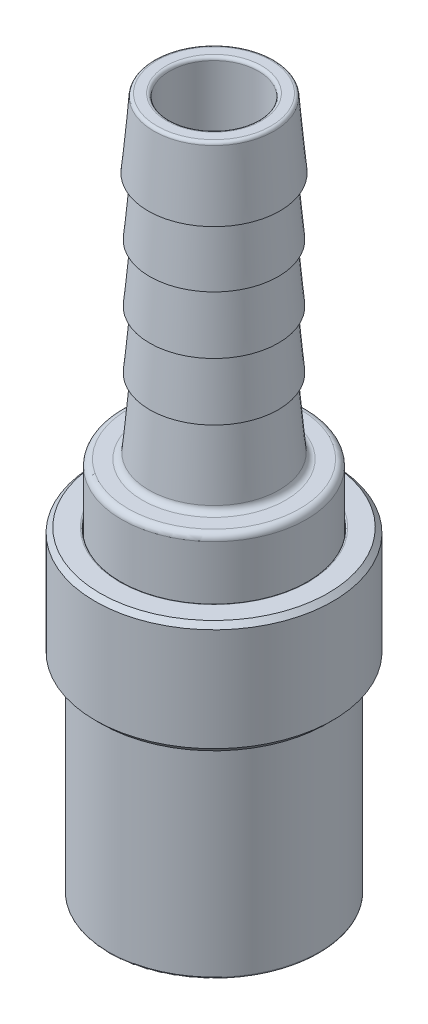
ISO-10303-21;
HEADER;
FILE_DESCRIPTION(('STEP AP214'),'2;1');
FILE_NAME('part.step','',(''),(''),'','','');
FILE_SCHEMA(('AUTOMOTIVE_DESIGN { 1 0 10303 214 1 1 1 1 }'));
ENDSEC;
DATA;
#1=APPLICATION_CONTEXT('core data for automotive mechanical design processes');
#2=APPLICATION_PROTOCOL_DEFINITION('international standard','automotive_design',2000,#1);
#3=PRODUCT_CONTEXT('',#1,'mechanical');
#4=PRODUCT('Part','Part','',(#3));
#5=PRODUCT_RELATED_PRODUCT_CATEGORY('part','',(#4));
#6=PRODUCT_DEFINITION_FORMATION('','',#4);
#7=PRODUCT_DEFINITION_CONTEXT('part definition',#1,'design');
#8=PRODUCT_DEFINITION('design','',#6,#7);
#9=PRODUCT_DEFINITION_SHAPE('','',#8);
#10=(LENGTH_UNIT() NAMED_UNIT(*) SI_UNIT(.MILLI.,.METRE.));
#11=(NAMED_UNIT(*) PLANE_ANGLE_UNIT() SI_UNIT($,.RADIAN.));
#12=(NAMED_UNIT(*) SI_UNIT($,.STERADIAN.) SOLID_ANGLE_UNIT());
#13=UNCERTAINTY_MEASURE_WITH_UNIT(LENGTH_MEASURE(1.E-05),#10,'distance_accuracy_value','');
#14=(GEOMETRIC_REPRESENTATION_CONTEXT(3) GLOBAL_UNCERTAINTY_ASSIGNED_CONTEXT((#13)) GLOBAL_UNIT_ASSIGNED_CONTEXT((#10,
#11,#12)) REPRESENTATION_CONTEXT('',''));
#15=CARTESIAN_POINT('',(0.,0.,0.));
#16=DIRECTION('',(0.,0.,1.));
#17=DIRECTION('',(1.,0.,0.));
#18=AXIS2_PLACEMENT_3D('',#15,#16,#17);
#19=CARTESIAN_POINT('',(0.,15.494,0.));
#20=DIRECTION('',(0.,-1.,0.));
#21=DIRECTION('',(0.,0.,-1.));
#22=AXIS2_PLACEMENT_3D('',#19,#20,#21);
#23=TOROIDAL_SURFACE('',#22,7.1501,0.254);
#24=CARTESIAN_POINT('',(0.,15.24,0.));
#25=DIRECTION('',(0.,1.,0.));
#26=DIRECTION('',(0.,0.,1.));
#27=AXIS2_PLACEMENT_3D('',#24,#25,#26);
#28=CIRCLE('',#27,7.1501);
#29=CARTESIAN_POINT('',(0.,15.24,-7.1501));
#30=VERTEX_POINT('',#29);
#31=CARTESIAN_POINT('',(0.,15.24,7.1501));
#32=VERTEX_POINT('',#31);
#33=EDGE_CURVE('P0_E11',#30,#32,#28,.T.);
#34=ORIENTED_EDGE('',*,*,#33,.T.);
#35=CARTESIAN_POINT('',(0.,15.494,7.1501));
#36=DIRECTION('',(-1.,0.,0.));
#37=DIRECTION('',(0.,0.,1.));
#38=AXIS2_PLACEMENT_3D('',#35,#36,#37);
#39=CIRCLE('',#38,0.254);
#40=CARTESIAN_POINT('',(0.,15.494,7.4041));
#41=VERTEX_POINT('',#40);
#42=EDGE_CURVE('P0_E27',#32,#41,#39,.T.);
#43=ORIENTED_EDGE('',*,*,#42,.T.);
#44=CARTESIAN_POINT('',(0.,15.494,0.));
#45=DIRECTION('',(0.,-1.,0.));
#46=DIRECTION('',(0.,0.,1.));
#47=AXIS2_PLACEMENT_3D('',#44,#45,#46);
#48=CIRCLE('',#47,7.4041);
#49=CARTESIAN_POINT('',(0.,15.494,-7.4041));
#50=VERTEX_POINT('',#49);
#51=EDGE_CURVE('P0_E334',#41,#50,#48,.T.);
#52=ORIENTED_EDGE('',*,*,#51,.T.);
#53=CARTESIAN_POINT('',(0.,15.494,0.));
#54=DIRECTION('',(0.,-1.,0.));
#55=DIRECTION('',(0.,0.,1.));
#56=AXIS2_PLACEMENT_3D('',#53,#54,#55);
#57=CIRCLE('',#56,7.4041);
#58=EDGE_CURVE('P0_E410',#50,#41,#57,.T.);
#59=ORIENTED_EDGE('',*,*,#58,.T.);
#60=ORIENTED_EDGE('',*,*,#42,.F.);
#61=CARTESIAN_POINT('',(0.,15.24,0.));
#62=DIRECTION('',(0.,1.,0.));
#63=DIRECTION('',(0.,0.,1.));
#64=AXIS2_PLACEMENT_3D('',#61,#62,#63);
#65=CIRCLE('',#64,7.1501);
#66=EDGE_CURVE('P0_E413',#32,#30,#65,.T.);
#67=ORIENTED_EDGE('',*,*,#66,.T.);
#68=EDGE_LOOP('',(#34,#43,#52,#59,#60,#67));
#69=FACE_BOUND('',#68,.T.);
#70=ADVANCED_FACE('P0_F16',(#69),#23,.T.);
#71=CARTESIAN_POINT('',(0.,22.6949,0.));
#72=DIRECTION('',(0.,-1.,0.));
#73=DIRECTION('',(0.,0.,-1.));
#74=AXIS2_PLACEMENT_3D('',#71,#72,#73);
#75=CYLINDRICAL_SURFACE('',#74,7.4041);
#76=DIRECTION('',(0.,1.,0.));
#77=VECTOR('',#76,1.);
#78=CARTESIAN_POINT('',(0.,22.6949,7.4041));
#79=LINE('',#78,#77);
#80=CARTESIAN_POINT('',(0.,25.3999996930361,7.4041));
#81=VERTEX_POINT('',#80);
#82=EDGE_CURVE('P0_E382',#41,#81,#79,.T.);
#83=ORIENTED_EDGE('',*,*,#82,.T.);
#84=ORIENTED_EDGE('',*,*,#82,.F.);
#85=ORIENTED_EDGE('',*,*,#58,.F.);
#86=ORIENTED_EDGE('',*,*,#51,.F.);
#87=EDGE_LOOP('',(#83,#84,#85,#86));
#88=FACE_BOUND('',#87,.T.);
#89=DIRECTION('',(0.,1.,0.));
#90=VECTOR('',#89,1.);
#91=CARTESIAN_POINT('',(0.,22.6949,7.4041));
#92=LINE('',#91,#90);
#93=CARTESIAN_POINT('',(0.,28.1939996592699,7.4041));
#94=VERTEX_POINT('',#93);
#95=CARTESIAN_POINT('',(0.,29.6418,7.4041));
#96=VERTEX_POINT('',#95);
#97=EDGE_CURVE('P0_E379',#94,#96,#92,.T.);
#98=ORIENTED_EDGE('',*,*,#97,.F.);
#99=ORIENTED_EDGE('',*,*,#97,.T.);
#100=CARTESIAN_POINT('',(0.,29.6418,0.));
#101=DIRECTION('',(0.,1.,0.));
#102=DIRECTION('',(0.,0.,1.));
#103=AXIS2_PLACEMENT_3D('',#100,#101,#102);
#104=CIRCLE('',#103,7.4041);
#105=CARTESIAN_POINT('',(0.,29.6418,-7.4041));
#106=VERTEX_POINT('',#105);
#107=EDGE_CURVE('P0_E330',#106,#96,#104,.T.);
#108=ORIENTED_EDGE('',*,*,#107,.F.);
#109=CARTESIAN_POINT('',(0.,29.6418,0.));
#110=DIRECTION('',(0.,1.,0.));
#111=DIRECTION('',(0.,0.,1.));
#112=AXIS2_PLACEMENT_3D('',#109,#110,#111);
#113=CIRCLE('',#112,7.4041);
#114=EDGE_CURVE('P0_E279',#96,#106,#113,.T.);
#115=ORIENTED_EDGE('',*,*,#114,.F.);
#116=EDGE_LOOP('',(#98,#99,#108,#115));
#117=FACE_BOUND('',#116,.T.);
#118=ADVANCED_FACE('P0_F683',(#88,#117),#75,.T.);
#119=CARTESIAN_POINT('',(0.,15.24,-6.35));
#120=DIRECTION('',(0.,-1.,0.));
#121=DIRECTION('',(0.,0.,-1.));
#122=AXIS2_PLACEMENT_3D('',#119,#120,#121);
#123=PLANE('',#122);
#124=ORIENTED_EDGE('',*,*,#33,.F.);
#125=ORIENTED_EDGE('',*,*,#66,.F.);
#126=EDGE_LOOP('',(#124,#125));
#127=FACE_BOUND('',#126,.T.);
#128=CARTESIAN_POINT('',(0.,15.24,0.));
#129=DIRECTION('',(0.,-1.,0.));
#130=DIRECTION('',(1.,0.,0.));
#131=AXIS2_PLACEMENT_3D('',#128,#129,#130);
#132=CIRCLE('',#131,6.35);
#133=CARTESIAN_POINT('',(0.,15.24,-6.35));
#134=VERTEX_POINT('',#133);
#135=CARTESIAN_POINT('',(0.,15.24,6.35));
#136=VERTEX_POINT('',#135);
#137=EDGE_CURVE('P0_E456',#134,#136,#132,.T.);
#138=ORIENTED_EDGE('',*,*,#137,.F.);
#139=CARTESIAN_POINT('',(0.,15.24,0.));
#140=DIRECTION('',(0.,-1.,0.));
#141=DIRECTION('',(1.,0.,0.));
#142=AXIS2_PLACEMENT_3D('',#139,#140,#141);
#143=CIRCLE('',#142,6.35);
#144=EDGE_CURVE('P0_E458',#136,#134,#143,.T.);
#145=ORIENTED_EDGE('',*,*,#144,.F.);
#146=EDGE_LOOP('',(#138,#145));
#147=FACE_BOUND('',#146,.T.);
#148=ADVANCED_FACE('P0_F688',(#127,#147),#123,.T.);
#149=CARTESIAN_POINT('',(0.,55.2958,0.));
#150=DIRECTION('',(0.,-1.,0.));
#151=DIRECTION('',(0.,0.,-1.));
#152=AXIS2_PLACEMENT_3D('',#149,#150,#151);
#153=TOROIDAL_SURFACE('',#152,3.82150992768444,0.254);
#154=CARTESIAN_POINT('',(0.,55.5498,0.));
#155=DIRECTION('',(0.,1.,0.));
#156=DIRECTION('',(0.,0.,1.));
#157=AXIS2_PLACEMENT_3D('',#154,#155,#156);
#158=CIRCLE('',#157,3.82150992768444);
#159=CARTESIAN_POINT('',(0.,55.5498,-3.82150992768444));
#160=VERTEX_POINT('',#159);
#161=CARTESIAN_POINT('',(0.,55.5498,3.82150992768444));
#162=VERTEX_POINT('',#161);
#163=EDGE_CURVE('P0_E383',#160,#162,#158,.T.);
#164=ORIENTED_EDGE('',*,*,#163,.T.);
#165=CARTESIAN_POINT('',(0.,55.2958,3.82150992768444));
#166=DIRECTION('',(-1.,0.,0.));
#167=DIRECTION('',(0.,0.,1.));
#168=AXIS2_PLACEMENT_3D('',#165,#166,#167);
#169=CIRCLE('',#168,0.254);
#170=CARTESIAN_POINT('',(0.,55.2958,3.56750992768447));
#171=VERTEX_POINT('',#170);
#172=EDGE_CURVE('P0_E405',#162,#171,#169,.T.);
#173=ORIENTED_EDGE('',*,*,#172,.T.);
#174=CARTESIAN_POINT('',(0.,55.2958,0.));
#175=DIRECTION('',(0.,-1.,0.));
#176=DIRECTION('',(0.,0.,1.));
#177=AXIS2_PLACEMENT_3D('',#174,#175,#176);
#178=CIRCLE('',#177,3.56750992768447);
#179=CARTESIAN_POINT('',(0.,55.2958,-3.56750992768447));
#180=VERTEX_POINT('',#179);
#181=EDGE_CURVE('P0_E409',#171,#180,#178,.T.);
#182=ORIENTED_EDGE('',*,*,#181,.T.);
#183=CARTESIAN_POINT('',(0.,55.2958,0.));
#184=DIRECTION('',(0.,-1.,0.));
#185=DIRECTION('',(0.,0.,1.));
#186=AXIS2_PLACEMENT_3D('',#183,#184,#185);
#187=CIRCLE('',#186,3.56750992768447);
#188=EDGE_CURVE('P0_E490',#180,#171,#187,.T.);
#189=ORIENTED_EDGE('',*,*,#188,.T.);
#190=ORIENTED_EDGE('',*,*,#172,.F.);
#191=CARTESIAN_POINT('',(0.,55.5498,0.));
#192=DIRECTION('',(0.,1.,0.));
#193=DIRECTION('',(0.,0.,1.));
#194=AXIS2_PLACEMENT_3D('',#191,#192,#193);
#195=CIRCLE('',#194,3.82150992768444);
#196=EDGE_CURVE('P0_E493',#162,#160,#195,.T.);
#197=ORIENTED_EDGE('',*,*,#196,.T.);
#198=EDGE_LOOP('',(#164,#173,#182,#189,#190,#197));
#199=FACE_BOUND('',#198,.T.);
#200=ADVANCED_FACE('P0_F632',(#199),#153,.T.);
#201=CARTESIAN_POINT('',(0.,55.5498,-4.79755572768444));
#202=DIRECTION('',(0.,1.,0.));
#203=DIRECTION('',(1.,0.,0.));
#204=AXIS2_PLACEMENT_3D('',#201,#202,#203);
#205=PLANE('',#204);
#206=CARTESIAN_POINT('',(0.,55.5498,0.));
#207=DIRECTION('',(0.,-1.,0.));
#208=DIRECTION('',(0.,0.,1.));
#209=AXIS2_PLACEMENT_3D('',#206,#207,#208);
#210=CIRCLE('',#209,4.56480760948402);
#211=CARTESIAN_POINT('',(0.,55.5498,-4.56480760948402));
#212=VERTEX_POINT('',#211);
#213=CARTESIAN_POINT('',(0.,55.5498,4.56480760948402));
#214=VERTEX_POINT('',#213);
#215=EDGE_CURVE('P0_E356',#212,#214,#210,.T.);
#216=ORIENTED_EDGE('',*,*,#215,.F.);
#217=CARTESIAN_POINT('',(0.,55.5498,0.));
#218=DIRECTION('',(0.,-1.,0.));
#219=DIRECTION('',(0.,0.,1.));
#220=AXIS2_PLACEMENT_3D('',#217,#218,#219);
#221=CIRCLE('',#220,4.56480760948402);
#222=EDGE_CURVE('P0_E377',#214,#212,#221,.T.);
#223=ORIENTED_EDGE('',*,*,#222,.F.);
#224=EDGE_LOOP('',(#216,#223));
#225=FACE_BOUND('',#224,.T.);
#226=ORIENTED_EDGE('',*,*,#163,.F.);
#227=ORIENTED_EDGE('',*,*,#196,.F.);
#228=EDGE_LOOP('',(#226,#227));
#229=FACE_BOUND('',#228,.T.);
#230=ADVANCED_FACE('P0_F628',(#225,#229),#205,.T.);
#231=CARTESIAN_POINT('',(0.,41.262414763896,0.));
#232=DIRECTION('',(0.,-1.,0.));
#233=DIRECTION('',(0.,0.,-1.));
#234=AXIS2_PLACEMENT_3D('',#231,#232,#233);
#235=CYLINDRICAL_SURFACE('',#234,3.56750992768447);
#236=CARTESIAN_POINT('',(0.,26.9750295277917,0.));
#237=DIRECTION('',(0.,-1.,0.));
#238=DIRECTION('',(1.,0.,0.));
#239=AXIS2_PLACEMENT_3D('',#236,#237,#238);
#240=CIRCLE('',#239,3.56750992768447);
#241=CARTESIAN_POINT('',(0.,26.9750295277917,-3.56750992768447));
#242=VERTEX_POINT('',#241);
#243=CARTESIAN_POINT('',(0.,26.9750295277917,3.56750992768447));
#244=VERTEX_POINT('',#243);
#245=EDGE_CURVE('P0_E397',#242,#244,#240,.T.);
#246=ORIENTED_EDGE('',*,*,#245,.T.);
#247=DIRECTION('',(0.,1.,0.));
#248=VECTOR('',#247,1.);
#249=CARTESIAN_POINT('',(0.,41.262414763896,3.56750992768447));
#250=LINE('',#249,#248);
#251=EDGE_CURVE('P0_E307',#244,#171,#250,.T.);
#252=ORIENTED_EDGE('',*,*,#251,.T.);
#253=ORIENTED_EDGE('',*,*,#188,.F.);
#254=ORIENTED_EDGE('',*,*,#181,.F.);
#255=ORIENTED_EDGE('',*,*,#251,.F.);
#256=CARTESIAN_POINT('',(0.,26.9750295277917,0.));
#257=DIRECTION('',(0.,-1.,0.));
#258=DIRECTION('',(1.,0.,0.));
#259=AXIS2_PLACEMENT_3D('',#256,#257,#258);
#260=CIRCLE('',#259,3.56750992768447);
#261=EDGE_CURVE('P0_E304',#244,#242,#260,.T.);
#262=ORIENTED_EDGE('',*,*,#261,.T.);
#263=EDGE_LOOP('',(#246,#252,#253,#254,#255,#262));
#264=FACE_BOUND('',#263,.T.);
#265=ADVANCED_FACE('P0_F631',(#264),#235,.F.);
#266=CARTESIAN_POINT('',(0.,55.2958,0.));
#267=DIRECTION('',(0.,-1.,0.));
#268=DIRECTION('',(0.,0.,-1.));
#269=AXIS2_PLACEMENT_3D('',#266,#267,#268);
#270=TOROIDAL_SURFACE('',#269,4.56480760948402,0.254);
#271=CARTESIAN_POINT('',(0.,55.317937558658,0.));
#272=DIRECTION('',(0.,1.,0.));
#273=DIRECTION('',(0.,0.,1.));
#274=AXIS2_PLACEMENT_3D('',#271,#272,#273);
#275=CIRCLE('',#274,4.81784106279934);
#276=CARTESIAN_POINT('',(0.,55.317937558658,-4.81784106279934));
#277=VERTEX_POINT('',#276);
#278=CARTESIAN_POINT('',(0.,55.317937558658,4.81784106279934));
#279=VERTEX_POINT('',#278);
#280=EDGE_CURVE('P0_E308',#277,#279,#275,.T.);
#281=ORIENTED_EDGE('',*,*,#280,.T.);
#282=CARTESIAN_POINT('',(0.,55.2958,4.56480760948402));
#283=DIRECTION('',(-1.,0.,0.));
#284=DIRECTION('',(0.,0.,1.));
#285=AXIS2_PLACEMENT_3D('',#282,#283,#284);
#286=CIRCLE('',#285,0.254);
#287=EDGE_CURVE('P0_E393',#279,#214,#286,.T.);
#288=ORIENTED_EDGE('',*,*,#287,.T.);
#289=ORIENTED_EDGE('',*,*,#222,.T.);
#290=ORIENTED_EDGE('',*,*,#215,.T.);
#291=ORIENTED_EDGE('',*,*,#287,.F.);
#292=CARTESIAN_POINT('',(0.,55.317937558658,0.));
#293=DIRECTION('',(0.,1.,0.));
#294=DIRECTION('',(0.,0.,1.));
#295=AXIS2_PLACEMENT_3D('',#292,#293,#294);
#296=CIRCLE('',#295,4.81784106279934);
#297=EDGE_CURVE('P0_E352',#279,#277,#296,.T.);
#298=ORIENTED_EDGE('',*,*,#297,.T.);
#299=EDGE_LOOP('',(#281,#288,#289,#290,#291,#298));
#300=FACE_BOUND('',#299,.T.);
#301=ADVANCED_FACE('P0_F625',(#300),#270,.T.);
#302=CARTESIAN_POINT('',(0.,52.7812,0.));
#303=DIRECTION('',(0.,-1.,0.));
#304=DIRECTION('',(0.,0.,-1.));
#305=AXIS2_PLACEMENT_3D('',#302,#303,#304);
#306=CONICAL_SURFACE('',#305,5.03977684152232,0.0872664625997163);
#307=CARTESIAN_POINT('',(0.,50.0126,0.));
#308=DIRECTION('',(0.,-1.,0.));
#309=DIRECTION('',(1.,0.,0.));
#310=AXIS2_PLACEMENT_3D('',#307,#308,#309);
#311=CIRCLE('',#310,5.2819979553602);
#312=CARTESIAN_POINT('',(0.,50.0126,-5.2819979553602));
#313=VERTEX_POINT('',#312);
#314=CARTESIAN_POINT('',(0.,50.0126,5.2819979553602));
#315=VERTEX_POINT('',#314);
#316=EDGE_CURVE('P0_E385',#313,#315,#311,.T.);
#317=ORIENTED_EDGE('',*,*,#316,.F.);
#318=CARTESIAN_POINT('',(0.,50.0126,0.));
#319=DIRECTION('',(0.,-1.,0.));
#320=DIRECTION('',(1.,0.,0.));
#321=AXIS2_PLACEMENT_3D('',#318,#319,#320);
#322=CIRCLE('',#321,5.2819979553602);
#323=EDGE_CURVE('P0_E20',#315,#313,#322,.T.);
#324=ORIENTED_EDGE('',*,*,#323,.F.);
#325=DIRECTION('',(0.,0.996194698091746,-0.087155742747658));
#326=VECTOR('',#325,1.);
#327=CARTESIAN_POINT('',(0.,52.7812,5.03977684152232));
#328=LINE('',#327,#326);
#329=EDGE_CURVE('P0_E357',#315,#279,#328,.T.);
#330=ORIENTED_EDGE('',*,*,#329,.T.);
#331=ORIENTED_EDGE('',*,*,#280,.F.);
#332=ORIENTED_EDGE('',*,*,#297,.F.);
#333=ORIENTED_EDGE('',*,*,#329,.F.);
#334=EDGE_LOOP('',(#317,#324,#330,#331,#332,#333));
#335=FACE_BOUND('',#334,.T.);
#336=ADVANCED_FACE('P0_F621',(#335),#306,.T.);
#337=CARTESIAN_POINT('',(0.,30.6578,0.));
#338=DIRECTION('',(0.,-1.,0.));
#339=DIRECTION('',(0.,0.,-1.));
#340=AXIS2_PLACEMENT_3D('',#337,#338,#339);
#341=TOROIDAL_SURFACE('',#340,5.73853623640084,0.508);
#342=CARTESIAN_POINT('',(0.,30.6135248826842,0.));
#343=DIRECTION('',(0.,-1.,0.));
#344=DIRECTION('',(0.,0.,1.));
#345=AXIS2_PLACEMENT_3D('',#342,#343,#344);
#346=CIRCLE('',#345,5.23246932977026);
#347=CARTESIAN_POINT('',(0.,30.6135248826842,-5.23246932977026));
#348=VERTEX_POINT('',#347);
#349=CARTESIAN_POINT('',(0.,30.6135248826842,5.23246932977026));
#350=VERTEX_POINT('',#349);
#351=EDGE_CURVE('P0_E562',#348,#350,#346,.T.);
#352=ORIENTED_EDGE('',*,*,#351,.T.);
#353=CARTESIAN_POINT('',(0.,30.6578,5.73853623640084));
#354=DIRECTION('',(-1.,0.,0.));
#355=DIRECTION('',(0.,0.,1.));
#356=AXIS2_PLACEMENT_3D('',#353,#354,#355);
#357=CIRCLE('',#356,0.508);
#358=CARTESIAN_POINT('',(0.,30.1498,5.73853623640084));
#359=VERTEX_POINT('',#358);
#360=EDGE_CURVE('P0_E521',#350,#359,#357,.T.);
#361=ORIENTED_EDGE('',*,*,#360,.T.);
#362=CARTESIAN_POINT('',(0.,30.1498,0.));
#363=DIRECTION('',(0.,1.,0.));
#364=DIRECTION('',(0.,0.,1.));
#365=AXIS2_PLACEMENT_3D('',#362,#363,#364);
#366=CIRCLE('',#365,5.73853623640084);
#367=CARTESIAN_POINT('',(0.,30.1498,-5.73853623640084));
#368=VERTEX_POINT('',#367);
#369=EDGE_CURVE('P0_E519',#359,#368,#366,.T.);
#370=ORIENTED_EDGE('',*,*,#369,.T.);
#371=CARTESIAN_POINT('',(0.,30.1498,0.));
#372=DIRECTION('',(0.,1.,0.));
#373=DIRECTION('',(0.,0.,1.));
#374=AXIS2_PLACEMENT_3D('',#371,#372,#373);
#375=CIRCLE('',#374,5.73853623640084);
#376=EDGE_CURVE('P0_E418',#368,#359,#375,.T.);
#377=ORIENTED_EDGE('',*,*,#376,.T.);
#378=ORIENTED_EDGE('',*,*,#360,.F.);
#379=CARTESIAN_POINT('',(0.,30.6135248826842,0.));
#380=DIRECTION('',(0.,-1.,0.));
#381=DIRECTION('',(0.,0.,1.));
#382=AXIS2_PLACEMENT_3D('',#379,#380,#381);
#383=CIRCLE('',#382,5.23246932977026);
#384=EDGE_CURVE('P0_E414',#350,#348,#383,.T.);
#385=ORIENTED_EDGE('',*,*,#384,.T.);
#386=EDGE_LOOP('',(#352,#361,#370,#377,#378,#385));
#387=FACE_BOUND('',#386,.T.);
#388=ADVANCED_FACE('P0_F566',(#387),#341,.F.);
#389=CARTESIAN_POINT('',(0.,30.1498,-7.4041));
#390=DIRECTION('',(0.,1.,0.));
#391=DIRECTION('',(1.,0.,0.));
#392=AXIS2_PLACEMENT_3D('',#389,#390,#391);
#393=PLANE('',#392);
#394=CARTESIAN_POINT('',(0.,30.1498,0.));
#395=DIRECTION('',(0.,-1.,0.));
#396=DIRECTION('',(0.,0.,1.));
#397=AXIS2_PLACEMENT_3D('',#394,#395,#396);
#398=CIRCLE('',#397,6.8961);
#399=CARTESIAN_POINT('',(0.,30.1498,-6.8961));
#400=VERTEX_POINT('',#399);
#401=CARTESIAN_POINT('',(0.,30.1498,6.8961));
#402=VERTEX_POINT('',#401);
#403=EDGE_CURVE('P0_E446',#400,#402,#398,.T.);
#404=ORIENTED_EDGE('',*,*,#403,.F.);
#405=CARTESIAN_POINT('',(0.,30.1498,0.));
#406=DIRECTION('',(0.,-1.,0.));
#407=DIRECTION('',(0.,0.,1.));
#408=AXIS2_PLACEMENT_3D('',#405,#406,#407);
#409=CIRCLE('',#408,6.8961);
#410=EDGE_CURVE('P0_E331',#402,#400,#409,.T.);
#411=ORIENTED_EDGE('',*,*,#410,.F.);
#412=EDGE_LOOP('',(#404,#411));
#413=FACE_BOUND('',#412,.T.);
#414=ORIENTED_EDGE('',*,*,#376,.F.);
#415=ORIENTED_EDGE('',*,*,#369,.F.);
#416=EDGE_LOOP('',(#414,#415));
#417=FACE_BOUND('',#416,.T.);
#418=ADVANCED_FACE('P0_F697',(#413,#417),#393,.T.);
#419=CARTESIAN_POINT('',(0.,33.147,0.));
#420=DIRECTION('',(0.,-1.,0.));
#421=DIRECTION('',(0.,0.,-1.));
#422=AXIS2_PLACEMENT_3D('',#419,#420,#421);
#423=CONICAL_SURFACE('',#422,5.0108189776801,0.0872664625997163);
#424=ORIENTED_EDGE('',*,*,#351,.F.);
#425=ORIENTED_EDGE('',*,*,#384,.F.);
#426=DIRECTION('',(0.,0.996194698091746,-0.0871557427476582));
#427=VECTOR('',#426,1.);
#428=CARTESIAN_POINT('',(0.,33.147,5.0108189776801));
#429=LINE('',#428,#427);
#430=CARTESIAN_POINT('',(0.,36.1442,4.7485979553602));
#431=VERTEX_POINT('',#430);
#432=EDGE_CURVE('P0_E361',#350,#431,#429,.T.);
#433=ORIENTED_EDGE('',*,*,#432,.T.);
#434=CARTESIAN_POINT('',(0.,36.1442,0.));
#435=DIRECTION('',(0.,-1.,0.));
#436=DIRECTION('',(1.,0.,0.));
#437=AXIS2_PLACEMENT_3D('',#434,#435,#436);
#438=CIRCLE('',#437,4.7485979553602);
#439=CARTESIAN_POINT('',(0.,36.1442,-4.7485979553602));
#440=VERTEX_POINT('',#439);
#441=EDGE_CURVE('P0_E358',#431,#440,#438,.T.);
#442=ORIENTED_EDGE('',*,*,#441,.T.);
#443=CARTESIAN_POINT('',(0.,36.1442,0.));
#444=DIRECTION('',(0.,-1.,0.));
#445=DIRECTION('',(1.,0.,0.));
#446=AXIS2_PLACEMENT_3D('',#443,#444,#445);
#447=CIRCLE('',#446,4.7485979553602);
#448=EDGE_CURVE('P0_E362',#440,#431,#447,.T.);
#449=ORIENTED_EDGE('',*,*,#448,.T.);
#450=ORIENTED_EDGE('',*,*,#432,.F.);
#451=EDGE_LOOP('',(#424,#425,#433,#442,#449,#450));
#452=FACE_BOUND('',#451,.T.);
#453=ADVANCED_FACE('P0_F558',(#452),#423,.T.);
#454=CARTESIAN_POINT('',(0.,29.6418,0.));
#455=DIRECTION('',(0.,-1.,0.));
#456=DIRECTION('',(0.,0.,-1.));
#457=AXIS2_PLACEMENT_3D('',#454,#455,#456);
#458=TOROIDAL_SURFACE('',#457,6.8961,0.508);
#459=ORIENTED_EDGE('',*,*,#107,.T.);
#460=CARTESIAN_POINT('',(0.,29.6418,6.8961));
#461=DIRECTION('',(-1.,0.,0.));
#462=DIRECTION('',(0.,0.,1.));
#463=AXIS2_PLACEMENT_3D('',#460,#461,#462);
#464=CIRCLE('',#463,0.508);
#465=EDGE_CURVE('P0_E326',#96,#402,#464,.T.);
#466=ORIENTED_EDGE('',*,*,#465,.T.);
#467=ORIENTED_EDGE('',*,*,#410,.T.);
#468=ORIENTED_EDGE('',*,*,#403,.T.);
#469=ORIENTED_EDGE('',*,*,#465,.F.);
#470=ORIENTED_EDGE('',*,*,#114,.T.);
#471=EDGE_LOOP('',(#459,#466,#467,#468,#469,#470));
#472=FACE_BOUND('',#471,.T.);
#473=ADVANCED_FACE('P0_F696',(#472),#458,.T.);
#474=CARTESIAN_POINT('',(0.,0.3937,0.));
#475=DIRECTION('',(0.,-1.,0.));
#476=DIRECTION('',(0.,0.,1.));
#477=AXIS2_PLACEMENT_3D('',#474,#475,#476);
#478=CONICAL_SURFACE('',#477,5.1689,0.785398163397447);
#479=CARTESIAN_POINT('',(0.,0.7874,0.));
#480=DIRECTION('',(0.,1.,0.));
#481=DIRECTION('',(0.,0.,1.));
#482=AXIS2_PLACEMENT_3D('',#479,#480,#481);
#483=CIRCLE('',#482,4.7752);
#484=CARTESIAN_POINT('',(0.,0.7874,-4.7752));
#485=VERTEX_POINT('',#484);
#486=CARTESIAN_POINT('',(0.,0.7874,4.7752));
#487=VERTEX_POINT('',#486);
#488=EDGE_CURVE('P0_E269',#485,#487,#483,.T.);
#489=ORIENTED_EDGE('',*,*,#488,.T.);
#490=CARTESIAN_POINT('',(0.,0.7874,0.));
#491=DIRECTION('',(0.,1.,0.));
#492=DIRECTION('',(0.,0.,1.));
#493=AXIS2_PLACEMENT_3D('',#490,#491,#492);
#494=CIRCLE('',#493,4.7752);
#495=EDGE_CURVE('P0_E263',#487,#485,#494,.T.);
#496=ORIENTED_EDGE('',*,*,#495,.T.);
#497=DIRECTION('',(0.,-0.707106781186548,-0.707106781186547));
#498=VECTOR('',#497,1.);
#499=CARTESIAN_POINT('',(0.,0.3937,-5.1689));
#500=LINE('',#499,#498);
#501=CARTESIAN_POINT('',(0.,0.,-5.5626));
#502=VERTEX_POINT('',#501);
#503=EDGE_CURVE('P0_E274',#485,#502,#500,.T.);
#504=ORIENTED_EDGE('',*,*,#503,.T.);
#505=CARTESIAN_POINT('',(0.,0.,0.));
#506=DIRECTION('',(0.,-1.,0.));
#507=DIRECTION('',(0.,0.,1.));
#508=AXIS2_PLACEMENT_3D('',#505,#506,#507);
#509=CIRCLE('',#508,5.5626);
#510=EDGE_CURVE('P0_E375',#502,#502,#509,.T.);
#511=ORIENTED_EDGE('',*,*,#510,.T.);
#512=ORIENTED_EDGE('',*,*,#503,.F.);
#513=EDGE_LOOP('',(#489,#496,#504,#511,#512));
#514=FACE_BOUND('',#513,.T.);
#515=ADVANCED_FACE('P0_F276',(#514),#478,.F.);
#516=CARTESIAN_POINT('',(0.,0.,-4.7752));
#517=DIRECTION('',(0.,-1.,0.));
#518=DIRECTION('',(0.,0.,-1.));
#519=AXIS2_PLACEMENT_3D('',#516,#517,#518);
#520=PLANE('',#519);
#521=CARTESIAN_POINT('',(0.,0.,0.));
#522=DIRECTION('',(0.,-1.,0.));
#523=DIRECTION('',(1.,0.,0.));
#524=AXIS2_PLACEMENT_3D('',#521,#522,#523);
#525=CIRCLE('',#524,6.35);
#526=CARTESIAN_POINT('',(0.,0.,-6.35));
#527=VERTEX_POINT('',#526);
#528=CARTESIAN_POINT('',(0.,0.,6.35));
#529=VERTEX_POINT('',#528);
#530=EDGE_CURVE('P0_E294',#527,#529,#525,.T.);
#531=ORIENTED_EDGE('',*,*,#530,.T.);
#532=CARTESIAN_POINT('',(0.,0.,0.));
#533=DIRECTION('',(0.,-1.,0.));
#534=DIRECTION('',(1.,0.,0.));
#535=AXIS2_PLACEMENT_3D('',#532,#533,#534);
#536=CIRCLE('',#535,6.35);
#537=EDGE_CURVE('P0_E286',#529,#527,#536,.T.);
#538=ORIENTED_EDGE('',*,*,#537,.T.);
#539=EDGE_LOOP('',(#531,#538));
#540=FACE_BOUND('',#539,.T.);
#541=ORIENTED_EDGE('',*,*,#510,.F.);
#542=EDGE_LOOP('',(#541));
#543=FACE_BOUND('',#542,.T.);
#544=ADVANCED_FACE('P0_F735',(#540,#543),#520,.T.);
#545=CARTESIAN_POINT('',(0.,4.05954229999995,0.));
#546=DIRECTION('',(0.,-1.,0.));
#547=DIRECTION('',(0.,0.,-1.));
#548=AXIS2_PLACEMENT_3D('',#545,#546,#547);
#549=CYLINDRICAL_SURFACE('',#548,4.7752);
#550=ORIENTED_EDGE('',*,*,#488,.F.);
#551=ORIENTED_EDGE('',*,*,#495,.F.);
#552=DIRECTION('',(0.,1.,0.));
#553=VECTOR('',#552,1.);
#554=CARTESIAN_POINT('',(0.,4.05954229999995,4.7752));
#555=LINE('',#554,#553);
#556=CARTESIAN_POINT('',(0.,8.11908459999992,4.7752));
#557=VERTEX_POINT('',#556);
#558=EDGE_CURVE('P0_E267',#487,#557,#555,.T.);
#559=ORIENTED_EDGE('',*,*,#558,.T.);
#560=CARTESIAN_POINT('',(0.,8.11908459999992,0.));
#561=DIRECTION('',(0.,-1.,0.));
#562=DIRECTION('',(1.,0.,0.));
#563=AXIS2_PLACEMENT_3D('',#560,#561,#562);
#564=CIRCLE('',#563,4.7752);
#565=CARTESIAN_POINT('',(0.,8.11908459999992,-4.7752));
#566=VERTEX_POINT('',#565);
#567=EDGE_CURVE('P0_E459',#566,#557,#564,.T.);
#568=ORIENTED_EDGE('',*,*,#567,.F.);
#569=CARTESIAN_POINT('',(0.,8.11908459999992,0.));
#570=DIRECTION('',(0.,-1.,0.));
#571=DIRECTION('',(1.,0.,0.));
#572=AXIS2_PLACEMENT_3D('',#569,#570,#571);
#573=CIRCLE('',#572,4.7752);
#574=EDGE_CURVE('P0_E283',#557,#566,#573,.T.);
#575=ORIENTED_EDGE('',*,*,#574,.F.);
#576=ORIENTED_EDGE('',*,*,#558,.F.);
#577=EDGE_LOOP('',(#550,#551,#559,#568,#575,#576));
#578=FACE_BOUND('',#577,.T.);
#579=ADVANCED_FACE('P0_F265',(#578),#549,.F.);
#580=CARTESIAN_POINT('',(0.,12.8524,-3.3782));
#581=DIRECTION('',(0.,-1.,0.));
#582=DIRECTION('',(0.,0.,-1.));
#583=AXIS2_PLACEMENT_3D('',#580,#581,#582);
#584=PLANE('',#583);
#585=CARTESIAN_POINT('',(0.,12.8524,0.));
#586=DIRECTION('',(0.,-1.,0.));
#587=DIRECTION('',(1.,0.,0.));
#588=AXIS2_PLACEMENT_3D('',#585,#586,#587);
#589=CIRCLE('',#588,5.0546);
#590=CARTESIAN_POINT('',(0.,12.8524,-5.0546));
#591=VERTEX_POINT('',#590);
#592=CARTESIAN_POINT('',(0.,12.8524,5.0546));
#593=VERTEX_POINT('',#592);
#594=EDGE_CURVE('P0_E287',#591,#593,#589,.T.);
#595=ORIENTED_EDGE('',*,*,#594,.T.);
#596=CARTESIAN_POINT('',(0.,12.8524,0.));
#597=DIRECTION('',(0.,-1.,0.));
#598=DIRECTION('',(1.,0.,0.));
#599=AXIS2_PLACEMENT_3D('',#596,#597,#598);
#600=CIRCLE('',#599,5.0546);
#601=EDGE_CURVE('P0_E298',#593,#591,#600,.T.);
#602=ORIENTED_EDGE('',*,*,#601,.T.);
#603=EDGE_LOOP('',(#595,#602));
#604=FACE_BOUND('',#603,.T.);
#605=CARTESIAN_POINT('',(0.,12.8524,0.));
#606=DIRECTION('',(0.,-1.,0.));
#607=DIRECTION('',(1.,0.,0.));
#608=AXIS2_PLACEMENT_3D('',#605,#606,#607);
#609=CIRCLE('',#608,3.3782);
#610=CARTESIAN_POINT('',(0.,12.8524,-3.3782));
#611=VERTEX_POINT('',#610);
#612=CARTESIAN_POINT('',(0.,12.8524,3.3782));
#613=VERTEX_POINT('',#612);
#614=EDGE_CURVE('P0_E484',#611,#613,#609,.T.);
#615=ORIENTED_EDGE('',*,*,#614,.F.);
#616=CARTESIAN_POINT('',(0.,12.8524,0.));
#617=DIRECTION('',(0.,-1.,0.));
#618=DIRECTION('',(1.,0.,0.));
#619=AXIS2_PLACEMENT_3D('',#616,#617,#618);
#620=CIRCLE('',#619,3.3782);
#621=EDGE_CURVE('P0_E419',#613,#611,#620,.T.);
#622=ORIENTED_EDGE('',*,*,#621,.F.);
#623=EDGE_LOOP('',(#615,#622));
#624=FACE_BOUND('',#623,.T.);
#625=ADVANCED_FACE('P0_F701',(#604,#624),#584,.T.);
#626=CARTESIAN_POINT('',(0.,19.9137147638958,0.));
#627=DIRECTION('',(0.,-1.,0.));
#628=DIRECTION('',(0.,0.,-1.));
#629=AXIS2_PLACEMENT_3D('',#626,#627,#628);
#630=CYLINDRICAL_SURFACE('',#629,3.3782);
#631=ORIENTED_EDGE('',*,*,#614,.T.);
#632=DIRECTION('',(0.,1.,0.));
#633=VECTOR('',#632,1.);
#634=CARTESIAN_POINT('',(0.,19.9137147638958,3.3782));
#635=LINE('',#634,#633);
#636=CARTESIAN_POINT('',(0.,26.9750295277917,3.3782));
#637=VERTEX_POINT('',#636);
#638=EDGE_CURVE('P0_E423',#613,#637,#635,.T.);
#639=ORIENTED_EDGE('',*,*,#638,.T.);
#640=CARTESIAN_POINT('',(0.,26.9750295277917,0.));
#641=DIRECTION('',(0.,-1.,0.));
#642=DIRECTION('',(1.,0.,0.));
#643=AXIS2_PLACEMENT_3D('',#640,#641,#642);
#644=CIRCLE('',#643,3.3782);
#645=CARTESIAN_POINT('',(0.,26.9750295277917,-3.3782));
#646=VERTEX_POINT('',#645);
#647=EDGE_CURVE('P0_E424',#646,#637,#644,.T.);
#648=ORIENTED_EDGE('',*,*,#647,.F.);
#649=CARTESIAN_POINT('',(0.,26.9750295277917,0.));
#650=DIRECTION('',(0.,-1.,0.));
#651=DIRECTION('',(1.,0.,0.));
#652=AXIS2_PLACEMENT_3D('',#649,#650,#651);
#653=CIRCLE('',#652,3.3782);
#654=EDGE_CURVE('P0_E389',#637,#646,#653,.T.);
#655=ORIENTED_EDGE('',*,*,#654,.F.);
#656=ORIENTED_EDGE('',*,*,#638,.F.);
#657=ORIENTED_EDGE('',*,*,#621,.T.);
#658=EDGE_LOOP('',(#631,#639,#648,#655,#656,#657));
#659=FACE_BOUND('',#658,.T.);
#660=ADVANCED_FACE('P0_F645',(#659),#630,.F.);
#661=CARTESIAN_POINT('',(0.,26.9750295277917,-3.56750992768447));
#662=DIRECTION('',(0.,1.,0.));
#663=DIRECTION('',(1.,0.,0.));
#664=AXIS2_PLACEMENT_3D('',#661,#662,#663);
#665=PLANE('',#664);
#666=ORIENTED_EDGE('',*,*,#245,.F.);
#667=ORIENTED_EDGE('',*,*,#261,.F.);
#668=EDGE_LOOP('',(#666,#667));
#669=FACE_BOUND('',#668,.T.);
#670=ORIENTED_EDGE('',*,*,#647,.T.);
#671=ORIENTED_EDGE('',*,*,#654,.T.);
#672=EDGE_LOOP('',(#670,#671));
#673=FACE_BOUND('',#672,.T.);
#674=ADVANCED_FACE('P0_F641',(#669,#673),#665,.T.);
#675=CARTESIAN_POINT('',(0.,50.0126,-4.7485979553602));
#676=DIRECTION('',(0.,-1.,0.));
#677=DIRECTION('',(0.,0.,-1.));
#678=AXIS2_PLACEMENT_3D('',#675,#676,#677);
#679=PLANE('',#678);
#680=ORIENTED_EDGE('',*,*,#316,.T.);
#681=ORIENTED_EDGE('',*,*,#323,.T.);
#682=EDGE_LOOP('',(#680,#681));
#683=FACE_BOUND('',#682,.T.);
#684=CARTESIAN_POINT('',(0.,50.0126,0.));
#685=DIRECTION('',(0.,-1.,0.));
#686=DIRECTION('',(1.,0.,0.));
#687=AXIS2_PLACEMENT_3D('',#684,#685,#686);
#688=CIRCLE('',#687,4.7485979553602);
#689=CARTESIAN_POINT('',(0.,50.0126,-4.7485979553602));
#690=VERTEX_POINT('',#689);
#691=CARTESIAN_POINT('',(0.,50.0126,4.7485979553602));
#692=VERTEX_POINT('',#691);
#693=EDGE_CURVE('P0_E350',#690,#692,#688,.T.);
#694=ORIENTED_EDGE('',*,*,#693,.F.);
#695=CARTESIAN_POINT('',(0.,50.0126,0.));
#696=DIRECTION('',(0.,-1.,0.));
#697=DIRECTION('',(1.,0.,0.));
#698=AXIS2_PLACEMENT_3D('',#695,#696,#697);
#699=CIRCLE('',#698,4.7485979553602);
#700=EDGE_CURVE('P0_E400',#692,#690,#699,.T.);
#701=ORIENTED_EDGE('',*,*,#700,.F.);
#702=EDGE_LOOP('',(#694,#701));
#703=FACE_BOUND('',#702,.T.);
#704=ADVANCED_FACE('P0_F644',(#683,#703),#679,.T.);
#705=CARTESIAN_POINT('',(0.,47.7012,0.));
#706=DIRECTION('',(0.,-1.,0.));
#707=DIRECTION('',(0.,0.,-1.));
#708=AXIS2_PLACEMENT_3D('',#705,#706,#707);
#709=CONICAL_SURFACE('',#708,4.95081925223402,0.0872664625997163);
#710=CARTESIAN_POINT('',(0.,45.3898,0.));
#711=DIRECTION('',(0.,-1.,0.));
#712=DIRECTION('',(1.,0.,0.));
#713=AXIS2_PLACEMENT_3D('',#710,#711,#712);
#714=CIRCLE('',#713,5.15304054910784);
#715=CARTESIAN_POINT('',(0.,45.3898,-5.15304054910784));
#716=VERTEX_POINT('',#715);
#717=CARTESIAN_POINT('',(0.,45.3898,5.15304054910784));
#718=VERTEX_POINT('',#717);
#719=EDGE_CURVE('P0_E346',#716,#718,#714,.T.);
#720=ORIENTED_EDGE('',*,*,#719,.F.);
#721=CARTESIAN_POINT('',(0.,45.3898,0.));
#722=DIRECTION('',(0.,-1.,0.));
#723=DIRECTION('',(1.,0.,0.));
#724=AXIS2_PLACEMENT_3D('',#721,#722,#723);
#725=CIRCLE('',#724,5.15304054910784);
#726=EDGE_CURVE('P0_E351',#718,#716,#725,.T.);
#727=ORIENTED_EDGE('',*,*,#726,.F.);
#728=DIRECTION('',(0.,0.996194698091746,-0.0871557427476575));
#729=VECTOR('',#728,1.);
#730=CARTESIAN_POINT('',(0.,47.7012,4.95081925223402));
#731=LINE('',#730,#729);
#732=EDGE_CURVE('P0_E404',#718,#692,#731,.T.);
#733=ORIENTED_EDGE('',*,*,#732,.T.);
#734=ORIENTED_EDGE('',*,*,#700,.T.);
#735=ORIENTED_EDGE('',*,*,#693,.T.);
#736=ORIENTED_EDGE('',*,*,#732,.F.);
#737=EDGE_LOOP('',(#720,#727,#733,#734,#735,#736));
#738=FACE_BOUND('',#737,.T.);
#739=ADVANCED_FACE('P0_F669',(#738),#709,.T.);
#740=CARTESIAN_POINT('',(0.,45.3898,-4.7485979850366));
#741=DIRECTION('',(0.,-1.,0.));
#742=DIRECTION('',(0.,0.,-1.));
#743=AXIS2_PLACEMENT_3D('',#740,#741,#742);
#744=PLANE('',#743);
#745=ORIENTED_EDGE('',*,*,#719,.T.);
#746=ORIENTED_EDGE('',*,*,#726,.T.);
#747=EDGE_LOOP('',(#745,#746));
#748=FACE_BOUND('',#747,.T.);
#749=CARTESIAN_POINT('',(0.,45.3898,0.));
#750=DIRECTION('',(0.,-1.,0.));
#751=DIRECTION('',(1.,0.,0.));
#752=AXIS2_PLACEMENT_3D('',#749,#750,#751);
#753=CIRCLE('',#752,4.7485979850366);
#754=CARTESIAN_POINT('',(0.,45.3898,-4.7485979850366));
#755=VERTEX_POINT('',#754);
#756=CARTESIAN_POINT('',(0.,45.3898,4.7485979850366));
#757=VERTEX_POINT('',#756);
#758=EDGE_CURVE('P0_E313',#755,#757,#753,.T.);
#759=ORIENTED_EDGE('',*,*,#758,.F.);
#760=CARTESIAN_POINT('',(0.,45.3898,0.));
#761=DIRECTION('',(0.,-1.,0.));
#762=DIRECTION('',(1.,0.,0.));
#763=AXIS2_PLACEMENT_3D('',#760,#761,#762);
#764=CIRCLE('',#763,4.7485979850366);
#765=EDGE_CURVE('P0_E321',#757,#755,#764,.T.);
#766=ORIENTED_EDGE('',*,*,#765,.F.);
#767=EDGE_LOOP('',(#759,#766));
#768=FACE_BOUND('',#767,.T.);
#769=ADVANCED_FACE('P0_F667',(#748,#768),#744,.T.);
#770=CARTESIAN_POINT('',(0.,43.0784,0.));
#771=DIRECTION('',(0.,-1.,0.));
#772=DIRECTION('',(0.,0.,-1.));
#773=AXIS2_PLACEMENT_3D('',#770,#771,#772);
#774=CONICAL_SURFACE('',#773,4.95081928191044,0.0872664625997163);
#775=CARTESIAN_POINT('',(0.,40.767,0.));
#776=DIRECTION('',(0.,-1.,0.));
#777=DIRECTION('',(1.,0.,0.));
#778=AXIS2_PLACEMENT_3D('',#775,#776,#777);
#779=CIRCLE('',#778,5.15304057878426);
#780=CARTESIAN_POINT('',(0.,40.767,-5.15304057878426));
#781=VERTEX_POINT('',#780);
#782=CARTESIAN_POINT('',(0.,40.767,5.15304057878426));
#783=VERTEX_POINT('',#782);
#784=EDGE_CURVE('P0_E309',#781,#783,#779,.T.);
#785=ORIENTED_EDGE('',*,*,#784,.F.);
#786=CARTESIAN_POINT('',(0.,40.767,0.));
#787=DIRECTION('',(0.,-1.,0.));
#788=DIRECTION('',(1.,0.,0.));
#789=AXIS2_PLACEMENT_3D('',#786,#787,#788);
#790=CIRCLE('',#789,5.15304057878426);
#791=EDGE_CURVE('P0_E314',#783,#781,#790,.T.);
#792=ORIENTED_EDGE('',*,*,#791,.F.);
#793=DIRECTION('',(0.,0.996194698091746,-0.0871557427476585));
#794=VECTOR('',#793,1.);
#795=CARTESIAN_POINT('',(0.,43.0784,4.95081928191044));
#796=LINE('',#795,#794);
#797=EDGE_CURVE('P0_E325',#783,#757,#796,.T.);
#798=ORIENTED_EDGE('',*,*,#797,.T.);
#799=ORIENTED_EDGE('',*,*,#765,.T.);
#800=ORIENTED_EDGE('',*,*,#758,.T.);
#801=ORIENTED_EDGE('',*,*,#797,.F.);
#802=EDGE_LOOP('',(#785,#792,#798,#799,#800,#801));
#803=FACE_BOUND('',#802,.T.);
#804=ADVANCED_FACE('P0_F532',(#803),#774,.T.);
#805=CARTESIAN_POINT('',(0.,40.767,-4.7485979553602));
#806=DIRECTION('',(0.,-1.,0.));
#807=DIRECTION('',(0.,0.,-1.));
#808=AXIS2_PLACEMENT_3D('',#805,#806,#807);
#809=PLANE('',#808);
#810=ORIENTED_EDGE('',*,*,#784,.T.);
#811=ORIENTED_EDGE('',*,*,#791,.T.);
#812=EDGE_LOOP('',(#810,#811));
#813=FACE_BOUND('',#812,.T.);
#814=CARTESIAN_POINT('',(0.,40.767,0.));
#815=DIRECTION('',(0.,-1.,0.));
#816=DIRECTION('',(1.,0.,0.));
#817=AXIS2_PLACEMENT_3D('',#814,#815,#816);
#818=CIRCLE('',#817,4.7485979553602);
#819=CARTESIAN_POINT('',(0.,40.767,-4.7485979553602));
#820=VERTEX_POINT('',#819);
#821=CARTESIAN_POINT('',(0.,40.767,4.7485979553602));
#822=VERTEX_POINT('',#821);
#823=EDGE_CURVE('P0_E430',#820,#822,#818,.T.);
#824=ORIENTED_EDGE('',*,*,#823,.F.);
#825=CARTESIAN_POINT('',(0.,40.767,0.));
#826=DIRECTION('',(0.,-1.,0.));
#827=DIRECTION('',(1.,0.,0.));
#828=AXIS2_PLACEMENT_3D('',#825,#826,#827);
#829=CIRCLE('',#828,4.7485979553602);
#830=EDGE_CURVE('P0_E425',#822,#820,#829,.T.);
#831=ORIENTED_EDGE('',*,*,#830,.F.);
#832=EDGE_LOOP('',(#824,#831));
#833=FACE_BOUND('',#832,.T.);
#834=ADVANCED_FACE('P0_F527',(#813,#833),#809,.T.);
#835=CARTESIAN_POINT('',(0.,38.4556,0.));
#836=DIRECTION('',(0.,-1.,0.));
#837=DIRECTION('',(0.,0.,-1.));
#838=AXIS2_PLACEMENT_3D('',#835,#836,#837);
#839=CONICAL_SURFACE('',#838,4.95081925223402,0.0872664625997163);
#840=CARTESIAN_POINT('',(0.,36.1442,0.));
#841=DIRECTION('',(0.,-1.,0.));
#842=DIRECTION('',(1.,0.,0.));
#843=AXIS2_PLACEMENT_3D('',#840,#841,#842);
#844=CIRCLE('',#843,5.15304054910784);
#845=CARTESIAN_POINT('',(0.,36.1442,-5.15304054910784));
#846=VERTEX_POINT('',#845);
#847=CARTESIAN_POINT('',(0.,36.1442,5.15304054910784));
#848=VERTEX_POINT('',#847);
#849=EDGE_CURVE('P0_E338',#846,#848,#844,.T.);
#850=ORIENTED_EDGE('',*,*,#849,.F.);
#851=CARTESIAN_POINT('',(0.,36.1442,0.));
#852=DIRECTION('',(0.,-1.,0.));
#853=DIRECTION('',(1.,0.,0.));
#854=AXIS2_PLACEMENT_3D('',#851,#852,#853);
#855=CIRCLE('',#854,5.15304054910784);
#856=EDGE_CURVE('P0_E335',#848,#846,#855,.T.);
#857=ORIENTED_EDGE('',*,*,#856,.F.);
#858=DIRECTION('',(0.,0.996194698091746,-0.0871557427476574));
#859=VECTOR('',#858,1.);
#860=CARTESIAN_POINT('',(0.,38.4556,4.95081925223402));
#861=LINE('',#860,#859);
#862=EDGE_CURVE('P0_E429',#848,#822,#861,.T.);
#863=ORIENTED_EDGE('',*,*,#862,.T.);
#864=ORIENTED_EDGE('',*,*,#830,.T.);
#865=ORIENTED_EDGE('',*,*,#823,.T.);
#866=ORIENTED_EDGE('',*,*,#862,.F.);
#867=EDGE_LOOP('',(#850,#857,#863,#864,#865,#866));
#868=FACE_BOUND('',#867,.T.);
#869=ADVANCED_FACE('P0_F711',(#868),#839,.T.);
#870=CARTESIAN_POINT('',(0.,36.1442,-4.7485979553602));
#871=DIRECTION('',(0.,-1.,0.));
#872=DIRECTION('',(0.,0.,-1.));
#873=AXIS2_PLACEMENT_3D('',#870,#871,#872);
#874=PLANE('',#873);
#875=ORIENTED_EDGE('',*,*,#849,.T.);
#876=ORIENTED_EDGE('',*,*,#856,.T.);
#877=EDGE_LOOP('',(#875,#876));
#878=FACE_BOUND('',#877,.T.);
#879=ORIENTED_EDGE('',*,*,#448,.F.);
#880=ORIENTED_EDGE('',*,*,#441,.F.);
#881=EDGE_LOOP('',(#879,#880));
#882=FACE_BOUND('',#881,.T.);
#883=ADVANCED_FACE('P0_F692',(#878,#882),#874,.T.);
#884=CARTESIAN_POINT('',(0.,7.62,0.));
#885=DIRECTION('',(0.,-1.,0.));
#886=DIRECTION('',(0.,0.,-1.));
#887=AXIS2_PLACEMENT_3D('',#884,#885,#886);
#888=CYLINDRICAL_SURFACE('',#887,6.35);
#889=ORIENTED_EDGE('',*,*,#530,.F.);
#890=ORIENTED_EDGE('',*,*,#537,.F.);
#891=DIRECTION('',(0.,1.,0.));
#892=VECTOR('',#891,1.);
#893=CARTESIAN_POINT('',(0.,7.62,6.35));
#894=LINE('',#893,#892);
#895=EDGE_CURVE('P0_E339',#529,#136,#894,.T.);
#896=ORIENTED_EDGE('',*,*,#895,.T.);
#897=ORIENTED_EDGE('',*,*,#144,.T.);
#898=ORIENTED_EDGE('',*,*,#137,.T.);
#899=ORIENTED_EDGE('',*,*,#895,.F.);
#900=EDGE_LOOP('',(#889,#890,#896,#897,#898,#899));
#901=FACE_BOUND('',#900,.T.);
#902=ADVANCED_FACE('P0_F807',(#901),#888,.T.);
#903=CARTESIAN_POINT('',(0.,8.19974043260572,0.));
#904=DIRECTION('',(0.,1.,0.));
#905=DIRECTION('',(0.,0.,-1.));
#906=AXIS2_PLACEMENT_3D('',#903,#904,#905);
#907=CONICAL_SURFACE('',#906,4.9149,1.0471975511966);
#908=ORIENTED_EDGE('',*,*,#567,.T.);
#909=DIRECTION('',(0.,0.5,0.866025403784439));
#910=VECTOR('',#909,1.);
#911=CARTESIAN_POINT('',(0.,8.19974043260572,4.9149));
#912=LINE('',#911,#910);
#913=CARTESIAN_POINT('',(0.,8.28039626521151,5.0546));
#914=VERTEX_POINT('',#913);
#915=EDGE_CURVE('P0_E435',#557,#914,#912,.T.);
#916=ORIENTED_EDGE('',*,*,#915,.T.);
#917=CARTESIAN_POINT('',(0.,8.28039626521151,0.));
#918=DIRECTION('',(0.,-1.,0.));
#919=DIRECTION('',(1.,0.,0.));
#920=AXIS2_PLACEMENT_3D('',#917,#918,#919);
#921=CIRCLE('',#920,5.0546);
#922=CARTESIAN_POINT('',(0.,8.28039626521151,-5.0546));
#923=VERTEX_POINT('',#922);
#924=EDGE_CURVE('P0_E436',#923,#914,#921,.T.);
#925=ORIENTED_EDGE('',*,*,#924,.F.);
#926=CARTESIAN_POINT('',(0.,8.28039626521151,0.));
#927=DIRECTION('',(0.,-1.,0.));
#928=DIRECTION('',(1.,0.,0.));
#929=AXIS2_PLACEMENT_3D('',#926,#927,#928);
#930=CIRCLE('',#929,5.0546);
#931=EDGE_CURVE('P0_E489',#914,#923,#930,.T.);
#932=ORIENTED_EDGE('',*,*,#931,.F.);
#933=ORIENTED_EDGE('',*,*,#915,.F.);
#934=ORIENTED_EDGE('',*,*,#574,.T.);
#935=EDGE_LOOP('',(#908,#916,#925,#932,#933,#934));
#936=FACE_BOUND('',#935,.T.);
#937=ADVANCED_FACE('P0_F18',(#936),#907,.F.);
#938=CARTESIAN_POINT('',(0.,8.73912166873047,0.));
#939=DIRECTION('',(0.,-1.,0.));
#940=DIRECTION('',(0.,0.,-1.));
#941=AXIS2_PLACEMENT_3D('',#938,#939,#940);
#942=CYLINDRICAL_SURFACE('',#941,5.0546);
#943=ORIENTED_EDGE('',*,*,#924,.T.);
#944=DIRECTION('',(0.,1.,0.));
#945=VECTOR('',#944,1.);
#946=CARTESIAN_POINT('',(0.,8.73912166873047,5.0546));
#947=LINE('',#946,#945);
#948=CARTESIAN_POINT('',(0.,9.19784707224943,5.0546));
#949=VERTEX_POINT('',#948);
#950=EDGE_CURVE('P0_E485',#914,#949,#947,.T.);
#951=ORIENTED_EDGE('',*,*,#950,.T.);
#952=CARTESIAN_POINT('',(0.,9.19784707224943,0.));
#953=DIRECTION('',(0.,-1.,0.));
#954=DIRECTION('',(1.,0.,0.));
#955=AXIS2_PLACEMENT_3D('',#952,#953,#954);
#956=CIRCLE('',#955,5.0546);
#957=CARTESIAN_POINT('',(0.,9.19784707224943,-5.0546));
#958=VERTEX_POINT('',#957);
#959=EDGE_CURVE('P0_E319',#958,#949,#956,.T.);
#960=ORIENTED_EDGE('',*,*,#959,.F.);
#961=CARTESIAN_POINT('',(0.,9.19784707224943,0.));
#962=DIRECTION('',(0.,-1.,0.));
#963=DIRECTION('',(1.,0.,0.));
#964=AXIS2_PLACEMENT_3D('',#961,#962,#963);
#965=CIRCLE('',#964,5.0546);
#966=EDGE_CURVE('P0_E320',#949,#958,#965,.T.);
#967=ORIENTED_EDGE('',*,*,#966,.F.);
#968=ORIENTED_EDGE('',*,*,#950,.F.);
#969=ORIENTED_EDGE('',*,*,#931,.T.);
#970=EDGE_LOOP('',(#943,#951,#960,#967,#968,#969));
#971=FACE_BOUND('',#970,.T.);
#972=ADVANCED_FACE('P0_F727',(#971),#942,.F.);
#973=CARTESIAN_POINT('',(0.,9.35256261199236,0.));
#974=DIRECTION('',(0.,1.,0.));
#975=DIRECTION('',(0.,0.,-1.));
#976=AXIS2_PLACEMENT_3D('',#973,#974,#975);
#977=CONICAL_SURFACE('',#976,5.2578,0.920041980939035);
#978=ORIENTED_EDGE('',*,*,#959,.T.);
#979=DIRECTION('',(0.,0.605786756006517,0.795627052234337));
#980=VECTOR('',#979,1.);
#981=CARTESIAN_POINT('',(0.,9.35256261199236,5.2578));
#982=LINE('',#981,#980);
#983=CARTESIAN_POINT('',(0.,9.50727815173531,5.461));
#984=VERTEX_POINT('',#983);
#985=EDGE_CURVE('P0_E315',#949,#984,#982,.T.);
#986=ORIENTED_EDGE('',*,*,#985,.T.);
#987=CARTESIAN_POINT('',(0.,9.50727815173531,0.));
#988=DIRECTION('',(0.,-1.,0.));
#989=DIRECTION('',(1.,0.,0.));
#990=AXIS2_PLACEMENT_3D('',#987,#988,#989);
#991=CIRCLE('',#990,5.461);
#992=CARTESIAN_POINT('',(0.,9.50727815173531,-5.461));
#993=VERTEX_POINT('',#992);
#994=EDGE_CURVE('P0_E341',#993,#984,#991,.T.);
#995=ORIENTED_EDGE('',*,*,#994,.F.);
#996=CARTESIAN_POINT('',(0.,9.50727815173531,0.));
#997=DIRECTION('',(0.,-1.,0.));
#998=DIRECTION('',(1.,0.,0.));
#999=AXIS2_PLACEMENT_3D('',#996,#997,#998);
#1000=CIRCLE('',#999,5.461);
#1001=EDGE_CURVE('P0_E497',#984,#993,#1000,.T.);
#1002=ORIENTED_EDGE('',*,*,#1001,.F.);
#1003=ORIENTED_EDGE('',*,*,#985,.F.);
#1004=ORIENTED_EDGE('',*,*,#966,.T.);
#1005=EDGE_LOOP('',(#978,#986,#995,#1002,#1003,#1004));
#1006=FACE_BOUND('',#1005,.T.);
#1007=ADVANCED_FACE('P0_F709',(#1006),#977,.F.);
#1008=CARTESIAN_POINT('',(0.,10.4597781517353,0.));
#1009=DIRECTION('',(0.,-1.,0.));
#1010=DIRECTION('',(0.,0.,-1.));
#1011=AXIS2_PLACEMENT_3D('',#1008,#1009,#1010);
#1012=CYLINDRICAL_SURFACE('',#1011,5.461);
#1013=ORIENTED_EDGE('',*,*,#994,.T.);
#1014=DIRECTION('',(0.,1.,0.));
#1015=VECTOR('',#1014,1.);
#1016=CARTESIAN_POINT('',(0.,10.4597781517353,5.461));
#1017=LINE('',#1016,#1015);
#1018=CARTESIAN_POINT('',(0.,11.4122781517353,5.461));
#1019=VERTEX_POINT('',#1018);
#1020=EDGE_CURVE('P0_E345',#984,#1019,#1017,.T.);
#1021=ORIENTED_EDGE('',*,*,#1020,.T.);
#1022=CARTESIAN_POINT('',(0.,11.4122781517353,0.));
#1023=DIRECTION('',(0.,-1.,0.));
#1024=DIRECTION('',(1.,0.,0.));
#1025=AXIS2_PLACEMENT_3D('',#1022,#1023,#1024);
#1026=CIRCLE('',#1025,5.461);
#1027=CARTESIAN_POINT('',(0.,11.4122781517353,-5.461));
#1028=VERTEX_POINT('',#1027);
#1029=EDGE_CURVE('P0_E302',#1028,#1019,#1026,.T.);
#1030=ORIENTED_EDGE('',*,*,#1029,.F.);
#1031=CARTESIAN_POINT('',(0.,11.4122781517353,0.));
#1032=DIRECTION('',(0.,-1.,0.));
#1033=DIRECTION('',(1.,0.,0.));
#1034=AXIS2_PLACEMENT_3D('',#1031,#1032,#1033);
#1035=CIRCLE('',#1034,5.461);
#1036=EDGE_CURVE('P0_E366',#1019,#1028,#1035,.T.);
#1037=ORIENTED_EDGE('',*,*,#1036,.F.);
#1038=ORIENTED_EDGE('',*,*,#1020,.F.);
#1039=ORIENTED_EDGE('',*,*,#1001,.T.);
#1040=EDGE_LOOP('',(#1013,#1021,#1030,#1037,#1038,#1039));
#1041=FACE_BOUND('',#1040,.T.);
#1042=ADVANCED_FACE('P0_F705',(#1041),#1012,.F.);
#1043=CARTESIAN_POINT('',(0.,11.4973390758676,0.));
#1044=DIRECTION('',(0.,-1.,0.));
#1045=DIRECTION('',(0.,0.,-1.));
#1046=AXIS2_PLACEMENT_3D('',#1043,#1044,#1045);
#1047=CONICAL_SURFACE('',#1046,5.2578,1.17435312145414);
#1048=ORIENTED_EDGE('',*,*,#1029,.T.);
#1049=DIRECTION('',(0.,0.386139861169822,-0.922440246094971));
#1050=VECTOR('',#1049,1.);
#1051=CARTESIAN_POINT('',(0.,11.4973390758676,5.2578));
#1052=LINE('',#1051,#1050);
#1053=CARTESIAN_POINT('',(0.,11.5824,5.0546));
#1054=VERTEX_POINT('',#1053);
#1055=EDGE_CURVE('P0_E370',#1019,#1054,#1052,.T.);
#1056=ORIENTED_EDGE('',*,*,#1055,.T.);
#1057=CARTESIAN_POINT('',(0.,11.5824,0.));
#1058=DIRECTION('',(0.,-1.,0.));
#1059=DIRECTION('',(1.,0.,0.));
#1060=AXIS2_PLACEMENT_3D('',#1057,#1058,#1059);
#1061=CIRCLE('',#1060,5.0546);
#1062=CARTESIAN_POINT('',(0.,11.5824,-5.0546));
#1063=VERTEX_POINT('',#1062);
#1064=EDGE_CURVE('P0_E371',#1063,#1054,#1061,.T.);
#1065=ORIENTED_EDGE('',*,*,#1064,.F.);
#1066=CARTESIAN_POINT('',(0.,11.5824,0.));
#1067=DIRECTION('',(0.,-1.,0.));
#1068=DIRECTION('',(1.,0.,0.));
#1069=AXIS2_PLACEMENT_3D('',#1066,#1067,#1068);
#1070=CIRCLE('',#1069,5.0546);
#1071=EDGE_CURVE('P0_E1043',#1054,#1063,#1070,.T.);
#1072=ORIENTED_EDGE('',*,*,#1071,.F.);
#1073=ORIENTED_EDGE('',*,*,#1055,.F.);
#1074=ORIENTED_EDGE('',*,*,#1036,.T.);
#1075=EDGE_LOOP('',(#1048,#1056,#1065,#1072,#1073,#1074));
#1076=FACE_BOUND('',#1075,.T.);
#1077=ADVANCED_FACE('P0_F708',(#1076),#1047,.F.);
#1078=CARTESIAN_POINT('',(0.,12.2174,0.));
#1079=DIRECTION('',(0.,-1.,0.));
#1080=DIRECTION('',(0.,0.,-1.));
#1081=AXIS2_PLACEMENT_3D('',#1078,#1079,#1080);
#1082=CYLINDRICAL_SURFACE('',#1081,5.0546);
#1083=ORIENTED_EDGE('',*,*,#1064,.T.);
#1084=DIRECTION('',(0.,1.,0.));
#1085=VECTOR('',#1084,1.);
#1086=CARTESIAN_POINT('',(0.,12.2174,5.0546));
#1087=LINE('',#1086,#1085);
#1088=EDGE_CURVE('P0_E480',#1054,#593,#1087,.T.);
#1089=ORIENTED_EDGE('',*,*,#1088,.T.);
#1090=ORIENTED_EDGE('',*,*,#594,.F.);
#1091=ORIENTED_EDGE('',*,*,#601,.F.);
#1092=ORIENTED_EDGE('',*,*,#1088,.F.);
#1093=ORIENTED_EDGE('',*,*,#1071,.T.);
#1094=EDGE_LOOP('',(#1083,#1089,#1090,#1091,#1092,#1093));
#1095=FACE_BOUND('',#1094,.T.);
#1096=ADVANCED_FACE('P0_F715',(#1095),#1082,.F.);
#1097=CLOSED_SHELL('',(#70,#118,#148,#200,#230,#265,#301,#336,#388,#418,#453,#473,#515,#544,
#579,#625,#660,#674,#704,#739,#769,#804,#834,#869,#883,#902,#937,#972,#1007,#1042,#1077,#1096));
#1098=MANIFOLD_SOLID_BREP('P0_B1',#1097);
#1099=CARTESIAN_POINT('',(0.,25.2095,0.));
#1100=DIRECTION('',(0.,-1.,0.));
#1101=DIRECTION('',(0.,0.,-1.));
#1102=AXIS2_PLACEMENT_3D('',#1099,#1100,#1101);
#1103=CONICAL_SURFACE('',#1102,9.3345,0.785398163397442);
#1104=CARTESIAN_POINT('',(0.,25.4,0.));
#1105=DIRECTION('',(0.,-1.,0.));
#1106=DIRECTION('',(0.,0.,-1.));
#1107=AXIS2_PLACEMENT_3D('',#1104,#1105,#1106);
#1108=CIRCLE('',#1107,9.144);
#1109=CARTESIAN_POINT('',(0.,25.4,9.144));
#1110=VERTEX_POINT('',#1109);
#1111=EDGE_CURVE('P1_E11',#1110,#1110,#1108,.T.);
#1112=ORIENTED_EDGE('',*,*,#1111,.T.);
#1113=DIRECTION('',(0.,-0.707106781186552,0.707106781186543));
#1114=VECTOR('',#1113,1.);
#1115=CARTESIAN_POINT('',(0.,25.2095,9.3345));
#1116=LINE('',#1115,#1114);
#1117=CARTESIAN_POINT('',(0.,25.019,9.525));
#1118=VERTEX_POINT('',#1117);
#1119=EDGE_CURVE('P1_E27',#1110,#1118,#1116,.T.);
#1120=ORIENTED_EDGE('',*,*,#1119,.T.);
#1121=CARTESIAN_POINT('',(0.,25.019,0.));
#1122=DIRECTION('',(0.,1.,0.));
#1123=DIRECTION('',(0.,0.,-1.));
#1124=AXIS2_PLACEMENT_3D('',#1121,#1122,#1123);
#1125=CIRCLE('',#1124,9.525);
#1126=CARTESIAN_POINT('',(0.,25.019,-9.525));
#1127=VERTEX_POINT('',#1126);
#1128=EDGE_CURVE('P1_E203',#1118,#1127,#1125,.T.);
#1129=ORIENTED_EDGE('',*,*,#1128,.T.);
#1130=CARTESIAN_POINT('',(0.,25.019,0.));
#1131=DIRECTION('',(0.,1.,0.));
#1132=DIRECTION('',(0.,0.,-1.));
#1133=AXIS2_PLACEMENT_3D('',#1130,#1131,#1132);
#1134=CIRCLE('',#1133,9.525);
#1135=EDGE_CURVE('P1_E181',#1127,#1118,#1134,.T.);
#1136=ORIENTED_EDGE('',*,*,#1135,.T.);
#1137=ORIENTED_EDGE('',*,*,#1119,.F.);
#1138=EDGE_LOOP('',(#1112,#1120,#1129,#1136,#1137));
#1139=FACE_BOUND('',#1138,.T.);
#1140=ADVANCED_FACE('P1_F16',(#1139),#1103,.T.);
#1141=CARTESIAN_POINT('',(0.,20.828,0.));
#1142=DIRECTION('',(0.,1.,0.));
#1143=DIRECTION('',(0.,0.,1.));
#1144=AXIS2_PLACEMENT_3D('',#1141,#1142,#1143);
#1145=CYLINDRICAL_SURFACE('',#1144,9.525);
#1146=ORIENTED_EDGE('',*,*,#1128,.F.);
#1147=ORIENTED_EDGE('',*,*,#1135,.F.);
#1148=DIRECTION('',(0.,-1.,0.));
#1149=VECTOR('',#1148,1.);
#1150=CARTESIAN_POINT('',(0.,20.828,-9.525));
#1151=LINE('',#1150,#1149);
#1152=CARTESIAN_POINT('',(0.,16.764,-9.525));
#1153=VERTEX_POINT('',#1152);
#1154=EDGE_CURVE('P1_E178',#1127,#1153,#1151,.T.);
#1155=ORIENTED_EDGE('',*,*,#1154,.T.);
#1156=CARTESIAN_POINT('',(0.,16.764,0.));
#1157=DIRECTION('',(0.,-1.,0.));
#1158=DIRECTION('',(0.,0.,-1.));
#1159=AXIS2_PLACEMENT_3D('',#1156,#1157,#1158);
#1160=CIRCLE('',#1159,9.525);
#1161=CARTESIAN_POINT('',(0.,16.764,9.525));
#1162=VERTEX_POINT('',#1161);
#1163=EDGE_CURVE('P1_E168',#1162,#1153,#1160,.T.);
#1164=ORIENTED_EDGE('',*,*,#1163,.F.);
#1165=CARTESIAN_POINT('',(0.,16.764,0.));
#1166=DIRECTION('',(0.,-1.,0.));
#1167=DIRECTION('',(0.,0.,-1.));
#1168=AXIS2_PLACEMENT_3D('',#1165,#1166,#1167);
#1169=CIRCLE('',#1168,9.525);
#1170=EDGE_CURVE('P1_E163',#1153,#1162,#1169,.T.);
#1171=ORIENTED_EDGE('',*,*,#1170,.F.);
#1172=ORIENTED_EDGE('',*,*,#1154,.F.);
#1173=EDGE_LOOP('',(#1146,#1147,#1155,#1164,#1171,#1172));
#1174=FACE_BOUND('',#1173,.T.);
#1175=ADVANCED_FACE('P1_F179',(#1174),#1145,.T.);
#1176=CARTESIAN_POINT('',(0.,25.4,7.4549));
#1177=DIRECTION('',(0.,1.,0.));
#1178=DIRECTION('',(1.,0.,0.));
#1179=AXIS2_PLACEMENT_3D('',#1176,#1177,#1178);
#1180=PLANE('',#1179);
#1181=ORIENTED_EDGE('',*,*,#1111,.F.);
#1182=EDGE_LOOP('',(#1181));
#1183=FACE_BOUND('',#1182,.T.);
#1184=CARTESIAN_POINT('',(0.,25.4,0.));
#1185=DIRECTION('',(0.,1.,0.));
#1186=DIRECTION('',(0.,0.,-1.));
#1187=AXIS2_PLACEMENT_3D('',#1184,#1185,#1186);
#1188=CIRCLE('',#1187,7.5819);
#1189=CARTESIAN_POINT('',(0.,25.4,-7.5819));
#1190=VERTEX_POINT('',#1189);
#1191=EDGE_CURVE('P1_E208',#1190,#1190,#1188,.T.);
#1192=ORIENTED_EDGE('',*,*,#1191,.F.);
#1193=EDGE_LOOP('',(#1192));
#1194=FACE_BOUND('',#1193,.T.);
#1195=ADVANCED_FACE('P1_F298',(#1183,#1194),#1180,.T.);
#1196=CARTESIAN_POINT('',(0.,6.096,0.));
#1197=DIRECTION('',(0.,1.,0.));
#1198=DIRECTION('',(0.,0.,1.));
#1199=AXIS2_PLACEMENT_3D('',#1196,#1197,#1198);
#1200=TOROIDAL_SURFACE('',#1199,6.6802,0.254);
#1201=CARTESIAN_POINT('',(0.,6.096,0.));
#1202=DIRECTION('',(0.,-1.,0.));
#1203=DIRECTION('',(0.,0.,-1.));
#1204=AXIS2_PLACEMENT_3D('',#1201,#1202,#1203);
#1205=CIRCLE('',#1204,6.4262);
#1206=CARTESIAN_POINT('',(0.,6.096,6.4262));
#1207=VERTEX_POINT('',#1206);
#1208=CARTESIAN_POINT('',(0.,6.096,-6.4262));
#1209=VERTEX_POINT('',#1208);
#1210=EDGE_CURVE('P1_E184',#1207,#1209,#1205,.T.);
#1211=ORIENTED_EDGE('',*,*,#1210,.T.);
#1212=CARTESIAN_POINT('',(0.,6.096,-6.6802));
#1213=DIRECTION('',(-1.,0.,0.));
#1214=DIRECTION('',(0.,0.,-1.));
#1215=AXIS2_PLACEMENT_3D('',#1212,#1213,#1214);
#1216=CIRCLE('',#1215,0.254);
#1217=CARTESIAN_POINT('',(0.,6.35,-6.6802));
#1218=VERTEX_POINT('',#1217);
#1219=EDGE_CURVE('P1_E262',#1209,#1218,#1216,.T.);
#1220=ORIENTED_EDGE('',*,*,#1219,.T.);
#1221=CARTESIAN_POINT('',(0.,6.35,0.));
#1222=DIRECTION('',(0.,1.,0.));
#1223=DIRECTION('',(0.,0.,-1.));
#1224=AXIS2_PLACEMENT_3D('',#1221,#1222,#1223);
#1225=CIRCLE('',#1224,6.6802);
#1226=CARTESIAN_POINT('',(0.,6.35,6.6802));
#1227=VERTEX_POINT('',#1226);
#1228=EDGE_CURVE('P1_E266',#1218,#1227,#1225,.T.);
#1229=ORIENTED_EDGE('',*,*,#1228,.T.);
#1230=CARTESIAN_POINT('',(0.,6.35,0.));
#1231=DIRECTION('',(0.,1.,0.));
#1232=DIRECTION('',(0.,0.,-1.));
#1233=AXIS2_PLACEMENT_3D('',#1230,#1231,#1232);
#1234=CIRCLE('',#1233,6.6802);
#1235=EDGE_CURVE('P1_E251',#1227,#1218,#1234,.T.);
#1236=ORIENTED_EDGE('',*,*,#1235,.T.);
#1237=ORIENTED_EDGE('',*,*,#1219,.F.);
#1238=CARTESIAN_POINT('',(0.,6.096,0.));
#1239=DIRECTION('',(0.,-1.,0.));
#1240=DIRECTION('',(0.,0.,-1.));
#1241=AXIS2_PLACEMENT_3D('',#1238,#1239,#1240);
#1242=CIRCLE('',#1241,6.4262);
#1243=EDGE_CURVE('P1_E247',#1209,#1207,#1242,.T.);
#1244=ORIENTED_EDGE('',*,*,#1243,.T.);
#1245=EDGE_LOOP('',(#1211,#1220,#1229,#1236,#1237,#1244));
#1246=FACE_BOUND('',#1245,.T.);
#1247=ADVANCED_FACE('P1_F304',(#1246),#1200,.T.);
#1248=CARTESIAN_POINT('',(0.,6.35,6.4262));
#1249=DIRECTION('',(0.,1.,0.));
#1250=DIRECTION('',(1.,0.,0.));
#1251=AXIS2_PLACEMENT_3D('',#1248,#1249,#1250);
#1252=PLANE('',#1251);
#1253=CARTESIAN_POINT('',(0.,6.35,0.));
#1254=DIRECTION('',(0.,-1.,0.));
#1255=DIRECTION('',(0.,0.,-1.));
#1256=AXIS2_PLACEMENT_3D('',#1253,#1254,#1255);
#1257=CIRCLE('',#1256,7.2009);
#1258=CARTESIAN_POINT('',(0.,6.35,7.2009));
#1259=VERTEX_POINT('',#1258);
#1260=CARTESIAN_POINT('',(0.,6.35,-7.2009));
#1261=VERTEX_POINT('',#1260);
#1262=EDGE_CURVE('P1_E216',#1259,#1261,#1257,.T.);
#1263=ORIENTED_EDGE('',*,*,#1262,.F.);
#1264=CARTESIAN_POINT('',(0.,6.35,0.));
#1265=DIRECTION('',(0.,-1.,0.));
#1266=DIRECTION('',(0.,0.,-1.));
#1267=AXIS2_PLACEMENT_3D('',#1264,#1265,#1266);
#1268=CIRCLE('',#1267,7.2009);
#1269=EDGE_CURVE('P1_E219',#1261,#1259,#1268,.T.);
#1270=ORIENTED_EDGE('',*,*,#1269,.F.);
#1271=EDGE_LOOP('',(#1263,#1270));
#1272=FACE_BOUND('',#1271,.T.);
#1273=ORIENTED_EDGE('',*,*,#1235,.F.);
#1274=ORIENTED_EDGE('',*,*,#1228,.F.);
#1275=EDGE_LOOP('',(#1273,#1274));
#1276=FACE_BOUND('',#1275,.T.);
#1277=ADVANCED_FACE('P1_F300',(#1272,#1276),#1252,.T.);
#1278=CARTESIAN_POINT('',(0.,4.1402,0.));
#1279=DIRECTION('',(0.,1.,0.));
#1280=DIRECTION('',(0.,0.,1.));
#1281=AXIS2_PLACEMENT_3D('',#1278,#1279,#1280);
#1282=CYLINDRICAL_SURFACE('',#1281,6.4262);
#1283=ORIENTED_EDGE('',*,*,#1210,.F.);
#1284=ORIENTED_EDGE('',*,*,#1243,.F.);
#1285=DIRECTION('',(0.,-1.,0.));
#1286=VECTOR('',#1285,1.);
#1287=CARTESIAN_POINT('',(0.,4.1402,-6.4262));
#1288=LINE('',#1287,#1286);
#1289=CARTESIAN_POINT('',(0.,1.9304,-6.4262));
#1290=VERTEX_POINT('',#1289);
#1291=EDGE_CURVE('P1_E252',#1209,#1290,#1288,.T.);
#1292=ORIENTED_EDGE('',*,*,#1291,.T.);
#1293=CARTESIAN_POINT('',(0.,1.9304,0.));
#1294=DIRECTION('',(0.,1.,0.));
#1295=DIRECTION('',(1.,0.,0.));
#1296=AXIS2_PLACEMENT_3D('',#1293,#1294,#1295);
#1297=CIRCLE('',#1296,6.4262);
#1298=CARTESIAN_POINT('',(0.,1.9304,6.4262));
#1299=VERTEX_POINT('',#1298);
#1300=EDGE_CURVE('P1_E244',#1299,#1290,#1297,.T.);
#1301=ORIENTED_EDGE('',*,*,#1300,.F.);
#1302=CARTESIAN_POINT('',(0.,1.9304,0.));
#1303=DIRECTION('',(0.,1.,0.));
#1304=DIRECTION('',(1.,0.,0.));
#1305=AXIS2_PLACEMENT_3D('',#1302,#1303,#1304);
#1306=CIRCLE('',#1305,6.4262);
#1307=EDGE_CURVE('P1_E209',#1290,#1299,#1306,.T.);
#1308=ORIENTED_EDGE('',*,*,#1307,.F.);
#1309=ORIENTED_EDGE('',*,*,#1291,.F.);
#1310=EDGE_LOOP('',(#1283,#1284,#1292,#1301,#1308,#1309));
#1311=FACE_BOUND('',#1310,.T.);
#1312=ADVANCED_FACE('P1_F303',(#1311),#1282,.F.);
#1313=CARTESIAN_POINT('',(0.,6.604,0.));
#1314=DIRECTION('',(0.,1.,0.));
#1315=DIRECTION('',(0.,0.,1.));
#1316=AXIS2_PLACEMENT_3D('',#1313,#1314,#1315);
#1317=TOROIDAL_SURFACE('',#1316,7.2009,0.254);
#1318=CARTESIAN_POINT('',(0.,6.604,0.));
#1319=DIRECTION('',(0.,1.,0.));
#1320=DIRECTION('',(0.,0.,-1.));
#1321=AXIS2_PLACEMENT_3D('',#1318,#1319,#1320);
#1322=CIRCLE('',#1321,7.4549);
#1323=CARTESIAN_POINT('',(0.,6.604,7.4549));
#1324=VERTEX_POINT('',#1323);
#1325=CARTESIAN_POINT('',(0.,6.604,-7.4549));
#1326=VERTEX_POINT('',#1325);
#1327=EDGE_CURVE('P1_E235',#1324,#1326,#1322,.T.);
#1328=ORIENTED_EDGE('',*,*,#1327,.T.);
#1329=CARTESIAN_POINT('',(0.,6.604,-7.2009));
#1330=DIRECTION('',(-1.,0.,0.));
#1331=DIRECTION('',(0.,0.,-1.));
#1332=AXIS2_PLACEMENT_3D('',#1329,#1330,#1331);
#1333=CIRCLE('',#1332,0.254);
#1334=EDGE_CURVE('P1_E229',#1326,#1261,#1333,.T.);
#1335=ORIENTED_EDGE('',*,*,#1334,.T.);
#1336=ORIENTED_EDGE('',*,*,#1269,.T.);
#1337=ORIENTED_EDGE('',*,*,#1262,.T.);
#1338=ORIENTED_EDGE('',*,*,#1334,.F.);
#1339=CARTESIAN_POINT('',(0.,6.604,0.));
#1340=DIRECTION('',(0.,1.,0.));
#1341=DIRECTION('',(0.,0.,-1.));
#1342=AXIS2_PLACEMENT_3D('',#1339,#1340,#1341);
#1343=CIRCLE('',#1342,7.4549);
#1344=EDGE_CURVE('P1_E220',#1326,#1324,#1343,.T.);
#1345=ORIENTED_EDGE('',*,*,#1344,.T.);
#1346=EDGE_LOOP('',(#1328,#1335,#1336,#1337,#1338,#1345));
#1347=FACE_BOUND('',#1346,.T.);
#1348=ADVANCED_FACE('P1_F306',(#1347),#1317,.F.);
#1349=CARTESIAN_POINT('',(0.,15.875,0.));
#1350=DIRECTION('',(0.,1.,0.));
#1351=DIRECTION('',(0.,0.,1.));
#1352=AXIS2_PLACEMENT_3D('',#1349,#1350,#1351);
#1353=CYLINDRICAL_SURFACE('',#1352,7.4549);
#1354=CARTESIAN_POINT('',(0.,25.273,0.));
#1355=DIRECTION('',(0.,-1.,0.));
#1356=DIRECTION('',(0.,0.,-1.));
#1357=AXIS2_PLACEMENT_3D('',#1354,#1355,#1356);
#1358=CIRCLE('',#1357,7.4549);
#1359=CARTESIAN_POINT('',(0.,25.273,7.4549));
#1360=VERTEX_POINT('',#1359);
#1361=CARTESIAN_POINT('',(0.,25.273,-7.4549));
#1362=VERTEX_POINT('',#1361);
#1363=EDGE_CURVE('P1_E224',#1360,#1362,#1358,.T.);
#1364=ORIENTED_EDGE('',*,*,#1363,.F.);
#1365=CARTESIAN_POINT('',(0.,25.273,0.));
#1366=DIRECTION('',(0.,-1.,0.));
#1367=DIRECTION('',(0.,0.,-1.));
#1368=AXIS2_PLACEMENT_3D('',#1365,#1366,#1367);
#1369=CIRCLE('',#1368,7.4549);
#1370=EDGE_CURVE('P1_E204',#1362,#1360,#1369,.T.);
#1371=ORIENTED_EDGE('',*,*,#1370,.F.);
#1372=DIRECTION('',(0.,-1.,0.));
#1373=VECTOR('',#1372,1.);
#1374=CARTESIAN_POINT('',(0.,15.875,-7.4549));
#1375=LINE('',#1374,#1373);
#1376=EDGE_CURVE('P1_E175',#1362,#1326,#1375,.T.);
#1377=ORIENTED_EDGE('',*,*,#1376,.T.);
#1378=ORIENTED_EDGE('',*,*,#1327,.F.);
#1379=ORIENTED_EDGE('',*,*,#1344,.F.);
#1380=ORIENTED_EDGE('',*,*,#1376,.F.);
#1381=EDGE_LOOP('',(#1364,#1371,#1377,#1378,#1379,#1380));
#1382=FACE_BOUND('',#1381,.T.);
#1383=ADVANCED_FACE('P1_F309',(#1382),#1353,.F.);
#1384=CARTESIAN_POINT('',(0.,16.51,0.));
#1385=DIRECTION('',(0.,1.,0.));
#1386=DIRECTION('',(0.,0.,-1.));
#1387=AXIS2_PLACEMENT_3D('',#1384,#1385,#1386);
#1388=CONICAL_SURFACE('',#1387,9.271,0.785398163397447);
#1389=ORIENTED_EDGE('',*,*,#1163,.T.);
#1390=ORIENTED_EDGE('',*,*,#1170,.T.);
#1391=DIRECTION('',(0.,-0.707106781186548,-0.707106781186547));
#1392=VECTOR('',#1391,1.);
#1393=CARTESIAN_POINT('',(0.,16.51,9.271));
#1394=LINE('',#1393,#1392);
#1395=CARTESIAN_POINT('',(0.,16.256,9.017));
#1396=VERTEX_POINT('',#1395);
#1397=EDGE_CURVE('P1_E172',#1162,#1396,#1394,.T.);
#1398=ORIENTED_EDGE('',*,*,#1397,.T.);
#1399=CARTESIAN_POINT('',(0.,16.256,0.));
#1400=DIRECTION('',(0.,1.,0.));
#1401=DIRECTION('',(0.,0.,-1.));
#1402=AXIS2_PLACEMENT_3D('',#1399,#1400,#1401);
#1403=CIRCLE('',#1402,9.017);
#1404=EDGE_CURVE('P1_E192',#1396,#1396,#1403,.T.);
#1405=ORIENTED_EDGE('',*,*,#1404,.T.);
#1406=ORIENTED_EDGE('',*,*,#1397,.F.);
#1407=EDGE_LOOP('',(#1389,#1390,#1398,#1405,#1406));
#1408=FACE_BOUND('',#1407,.T.);
#1409=ADVANCED_FACE('P1_F170',(#1408),#1388,.T.);
#1410=CARTESIAN_POINT('',(0.,16.256,9.525));
#1411=DIRECTION('',(0.,-1.,0.));
#1412=DIRECTION('',(0.,0.,-1.));
#1413=AXIS2_PLACEMENT_3D('',#1410,#1411,#1412);
#1414=PLANE('',#1413);
#1415=ORIENTED_EDGE('',*,*,#1404,.F.);
#1416=EDGE_LOOP('',(#1415));
#1417=FACE_BOUND('',#1416,.T.);
#1418=CARTESIAN_POINT('',(0.,16.256,0.));
#1419=DIRECTION('',(0.,1.,0.));
#1420=DIRECTION('',(1.,0.,0.));
#1421=AXIS2_PLACEMENT_3D('',#1418,#1419,#1420);
#1422=CIRCLE('',#1421,8.4328);
#1423=CARTESIAN_POINT('',(0.,16.256,8.4328));
#1424=VERTEX_POINT('',#1423);
#1425=CARTESIAN_POINT('',(0.,16.256,-8.4328));
#1426=VERTEX_POINT('',#1425);
#1427=EDGE_CURVE('P1_E199',#1424,#1426,#1422,.T.);
#1428=ORIENTED_EDGE('',*,*,#1427,.T.);
#1429=CARTESIAN_POINT('',(0.,16.256,0.));
#1430=DIRECTION('',(0.,1.,0.));
#1431=DIRECTION('',(1.,0.,0.));
#1432=AXIS2_PLACEMENT_3D('',#1429,#1430,#1431);
#1433=CIRCLE('',#1432,8.4328);
#1434=EDGE_CURVE('P1_E196',#1426,#1424,#1433,.T.);
#1435=ORIENTED_EDGE('',*,*,#1434,.T.);
#1436=EDGE_LOOP('',(#1428,#1435));
#1437=FACE_BOUND('',#1436,.T.);
#1438=ADVANCED_FACE('P1_F342',(#1417,#1437),#1414,.T.);
#1439=CARTESIAN_POINT('',(0.,0.127,0.));
#1440=DIRECTION('',(0.,1.,0.));
#1441=DIRECTION('',(0.,0.,1.));
#1442=AXIS2_PLACEMENT_3D('',#1439,#1440,#1441);
#1443=TOROIDAL_SURFACE('',#1442,8.3058,0.127);
#1444=CARTESIAN_POINT('',(0.,0.127,0.));
#1445=DIRECTION('',(0.,-1.,0.));
#1446=DIRECTION('',(0.,0.,-1.));
#1447=AXIS2_PLACEMENT_3D('',#1444,#1445,#1446);
#1448=CIRCLE('',#1447,8.4328);
#1449=CARTESIAN_POINT('',(0.,0.127,8.4328));
#1450=VERTEX_POINT('',#1449);
#1451=CARTESIAN_POINT('',(0.,0.127,-8.4328));
#1452=VERTEX_POINT('',#1451);
#1453=EDGE_CURVE('P1_E130',#1450,#1452,#1448,.T.);
#1454=ORIENTED_EDGE('',*,*,#1453,.T.);
#1455=CARTESIAN_POINT('',(0.,0.127,-8.3058));
#1456=DIRECTION('',(-1.,0.,0.));
#1457=DIRECTION('',(0.,0.,-1.));
#1458=AXIS2_PLACEMENT_3D('',#1455,#1456,#1457);
#1459=CIRCLE('',#1458,0.127);
#1460=CARTESIAN_POINT('',(0.,0.,-8.3058));
#1461=VERTEX_POINT('',#1460);
#1462=EDGE_CURVE('P1_E478',#1452,#1461,#1459,.T.);
#1463=ORIENTED_EDGE('',*,*,#1462,.T.);
#1464=CARTESIAN_POINT('',(0.,0.,0.));
#1465=DIRECTION('',(0.,1.,0.));
#1466=DIRECTION('',(0.,0.,-1.));
#1467=AXIS2_PLACEMENT_3D('',#1464,#1465,#1466);
#1468=CIRCLE('',#1467,8.3058);
#1469=CARTESIAN_POINT('',(0.,0.,8.3058));
#1470=VERTEX_POINT('',#1469);
#1471=EDGE_CURVE('P1_E461',#1461,#1470,#1468,.T.);
#1472=ORIENTED_EDGE('',*,*,#1471,.T.);
#1473=CARTESIAN_POINT('',(0.,0.,0.));
#1474=DIRECTION('',(0.,1.,0.));
#1475=DIRECTION('',(0.,0.,-1.));
#1476=AXIS2_PLACEMENT_3D('',#1473,#1474,#1475);
#1477=CIRCLE('',#1476,8.3058);
#1478=EDGE_CURVE('P1_E467',#1470,#1461,#1477,.T.);
#1479=ORIENTED_EDGE('',*,*,#1478,.T.);
#1480=ORIENTED_EDGE('',*,*,#1462,.F.);
#1481=CARTESIAN_POINT('',(0.,0.127,0.));
#1482=DIRECTION('',(0.,-1.,0.));
#1483=DIRECTION('',(0.,0.,-1.));
#1484=AXIS2_PLACEMENT_3D('',#1481,#1482,#1483);
#1485=CIRCLE('',#1484,8.4328);
#1486=EDGE_CURVE('P1_E223',#1452,#1450,#1485,.T.);
#1487=ORIENTED_EDGE('',*,*,#1486,.T.);
#1488=EDGE_LOOP('',(#1454,#1463,#1472,#1479,#1480,#1487));
#1489=FACE_BOUND('',#1488,.T.);
#1490=ADVANCED_FACE('P1_F329',(#1489),#1443,.T.);
#1491=CARTESIAN_POINT('',(0.,0.,8.4328));
#1492=DIRECTION('',(0.,-1.,0.));
#1493=DIRECTION('',(0.,0.,-1.));
#1494=AXIS2_PLACEMENT_3D('',#1491,#1492,#1493);
#1495=PLANE('',#1494);
#1496=ORIENTED_EDGE('',*,*,#1478,.F.);
#1497=ORIENTED_EDGE('',*,*,#1471,.F.);
#1498=EDGE_LOOP('',(#1496,#1497));
#1499=FACE_BOUND('',#1498,.T.);
#1500=CARTESIAN_POINT('',(0.,0.,0.));
#1501=DIRECTION('',(0.,-1.,0.));
#1502=DIRECTION('',(0.,0.,-1.));
#1503=AXIS2_PLACEMENT_3D('',#1500,#1501,#1502);
#1504=CIRCLE('',#1503,7.4422);
#1505=CARTESIAN_POINT('',(0.,0.,7.4422));
#1506=VERTEX_POINT('',#1505);
#1507=CARTESIAN_POINT('',(0.,0.,-7.4422));
#1508=VERTEX_POINT('',#1507);
#1509=EDGE_CURVE('P1_E120',#1506,#1508,#1504,.T.);
#1510=ORIENTED_EDGE('',*,*,#1509,.F.);
#1511=CARTESIAN_POINT('',(0.,0.,0.));
#1512=DIRECTION('',(0.,-1.,0.));
#1513=DIRECTION('',(0.,0.,-1.));
#1514=AXIS2_PLACEMENT_3D('',#1511,#1512,#1513);
#1515=CIRCLE('',#1514,7.4422);
#1516=EDGE_CURVE('P1_E116',#1508,#1506,#1515,.T.);
#1517=ORIENTED_EDGE('',*,*,#1516,.F.);
#1518=EDGE_LOOP('',(#1510,#1517));
#1519=FACE_BOUND('',#1518,.T.);
#1520=ADVANCED_FACE('P1_F326',(#1499,#1519),#1495,.T.);
#1521=CARTESIAN_POINT('',(0.,8.128,0.));
#1522=DIRECTION('',(0.,1.,0.));
#1523=DIRECTION('',(0.,0.,1.));
#1524=AXIS2_PLACEMENT_3D('',#1521,#1522,#1523);
#1525=CYLINDRICAL_SURFACE('',#1524,8.4328);
#1526=ORIENTED_EDGE('',*,*,#1427,.F.);
#1527=ORIENTED_EDGE('',*,*,#1434,.F.);
#1528=DIRECTION('',(0.,-1.,0.));
#1529=VECTOR('',#1528,1.);
#1530=CARTESIAN_POINT('',(0.,8.128,-8.4328));
#1531=LINE('',#1530,#1529);
#1532=EDGE_CURVE('P1_E221',#1426,#1452,#1531,.T.);
#1533=ORIENTED_EDGE('',*,*,#1532,.T.);
#1534=ORIENTED_EDGE('',*,*,#1453,.F.);
#1535=ORIENTED_EDGE('',*,*,#1486,.F.);
#1536=ORIENTED_EDGE('',*,*,#1532,.F.);
#1537=EDGE_LOOP('',(#1526,#1527,#1533,#1534,#1535,#1536));
#1538=FACE_BOUND('',#1537,.T.);
#1539=ADVANCED_FACE('P1_F18',(#1538),#1525,.T.);
#1540=CARTESIAN_POINT('',(0.,25.273,0.));
#1541=DIRECTION('',(0.,1.,0.));
#1542=DIRECTION('',(0.,0.,1.));
#1543=AXIS2_PLACEMENT_3D('',#1540,#1541,#1542);
#1544=TOROIDAL_SURFACE('',#1543,7.5819,0.127);
#1545=ORIENTED_EDGE('',*,*,#1363,.T.);
#1546=CARTESIAN_POINT('',(0.,25.273,-7.5819));
#1547=DIRECTION('',(-1.,0.,0.));
#1548=DIRECTION('',(0.,0.,-1.));
#1549=AXIS2_PLACEMENT_3D('',#1546,#1547,#1548);
#1550=CIRCLE('',#1549,0.127);
#1551=EDGE_CURVE('P1_E277',#1362,#1190,#1550,.T.);
#1552=ORIENTED_EDGE('',*,*,#1551,.T.);
#1553=ORIENTED_EDGE('',*,*,#1191,.T.);
#1554=ORIENTED_EDGE('',*,*,#1551,.F.);
#1555=ORIENTED_EDGE('',*,*,#1370,.T.);
#1556=EDGE_LOOP('',(#1545,#1552,#1553,#1554,#1555));
#1557=FACE_BOUND('',#1556,.T.);
#1558=ADVANCED_FACE('P1_F331',(#1557),#1544,.T.);
#1559=CARTESIAN_POINT('',(0.,0.127,0.));
#1560=DIRECTION('',(0.,1.,0.));
#1561=DIRECTION('',(0.,0.,1.));
#1562=AXIS2_PLACEMENT_3D('',#1559,#1560,#1561);
#1563=TOROIDAL_SURFACE('',#1562,7.4422,0.127);
#1564=ORIENTED_EDGE('',*,*,#1509,.T.);
#1565=CARTESIAN_POINT('',(0.,0.127,-7.4422));
#1566=DIRECTION('',(-1.,0.,0.));
#1567=DIRECTION('',(0.,0.,-1.));
#1568=AXIS2_PLACEMENT_3D('',#1565,#1566,#1567);
#1569=CIRCLE('',#1568,0.127);
#1570=CARTESIAN_POINT('',(0.,0.127,-7.3152));
#1571=VERTEX_POINT('',#1570);
#1572=EDGE_CURVE('P1_E238',#1508,#1571,#1569,.T.);
#1573=ORIENTED_EDGE('',*,*,#1572,.T.);
#1574=CARTESIAN_POINT('',(0.,0.127,0.));
#1575=DIRECTION('',(0.,1.,0.));
#1576=DIRECTION('',(0.,0.,-1.));
#1577=AXIS2_PLACEMENT_3D('',#1574,#1575,#1576);
#1578=CIRCLE('',#1577,7.3152);
#1579=CARTESIAN_POINT('',(0.,0.127,7.3152));
#1580=VERTEX_POINT('',#1579);
#1581=EDGE_CURVE('P1_E273',#1571,#1580,#1578,.T.);
#1582=ORIENTED_EDGE('',*,*,#1581,.T.);
#1583=CARTESIAN_POINT('',(0.,0.127,0.));
#1584=DIRECTION('',(0.,1.,0.));
#1585=DIRECTION('',(0.,0.,-1.));
#1586=AXIS2_PLACEMENT_3D('',#1583,#1584,#1585);
#1587=CIRCLE('',#1586,7.3152);
#1588=EDGE_CURVE('P1_E280',#1580,#1571,#1587,.T.);
#1589=ORIENTED_EDGE('',*,*,#1588,.T.);
#1590=ORIENTED_EDGE('',*,*,#1572,.F.);
#1591=ORIENTED_EDGE('',*,*,#1516,.T.);
#1592=EDGE_LOOP('',(#1564,#1573,#1582,#1589,#1590,#1591));
#1593=FACE_BOUND('',#1592,.T.);
#1594=ADVANCED_FACE('P1_F315',(#1593),#1563,.T.);
#1595=CARTESIAN_POINT('',(0.,0.5207,0.));
#1596=DIRECTION('',(0.,1.,0.));
#1597=DIRECTION('',(0.,0.,1.));
#1598=AXIS2_PLACEMENT_3D('',#1595,#1596,#1597);
#1599=CYLINDRICAL_SURFACE('',#1598,7.3152);
#1600=CARTESIAN_POINT('',(0.,1.0414,0.));
#1601=DIRECTION('',(0.,1.,0.));
#1602=DIRECTION('',(1.,0.,0.));
#1603=AXIS2_PLACEMENT_3D('',#1600,#1601,#1602);
#1604=CIRCLE('',#1603,7.3152);
#1605=CARTESIAN_POINT('',(0.,1.0414,7.3152));
#1606=VERTEX_POINT('',#1605);
#1607=CARTESIAN_POINT('',(0.,1.0414,-7.3152));
#1608=VERTEX_POINT('',#1607);
#1609=EDGE_CURVE('P1_E281',#1606,#1608,#1604,.T.);
#1610=ORIENTED_EDGE('',*,*,#1609,.T.);
#1611=DIRECTION('',(0.,-1.,0.));
#1612=VECTOR('',#1611,1.);
#1613=CARTESIAN_POINT('',(0.,0.5207,-7.3152));
#1614=LINE('',#1613,#1612);
#1615=EDGE_CURVE('P1_E243',#1608,#1571,#1614,.T.);
#1616=ORIENTED_EDGE('',*,*,#1615,.T.);
#1617=ORIENTED_EDGE('',*,*,#1588,.F.);
#1618=ORIENTED_EDGE('',*,*,#1581,.F.);
#1619=ORIENTED_EDGE('',*,*,#1615,.F.);
#1620=CARTESIAN_POINT('',(0.,1.0414,0.));
#1621=DIRECTION('',(0.,1.,0.));
#1622=DIRECTION('',(1.,0.,0.));
#1623=AXIS2_PLACEMENT_3D('',#1620,#1621,#1622);
#1624=CIRCLE('',#1623,7.3152);
#1625=EDGE_CURVE('P1_E239',#1608,#1606,#1624,.T.);
#1626=ORIENTED_EDGE('',*,*,#1625,.T.);
#1627=EDGE_LOOP('',(#1610,#1616,#1617,#1618,#1619,#1626));
#1628=FACE_BOUND('',#1627,.T.);
#1629=ADVANCED_FACE('P1_F311',(#1628),#1599,.F.);
#1630=CARTESIAN_POINT('',(0.,1.4859,0.));
#1631=DIRECTION('',(0.,-1.,0.));
#1632=DIRECTION('',(0.,0.,1.));
#1633=AXIS2_PLACEMENT_3D('',#1630,#1631,#1632);
#1634=CONICAL_SURFACE('',#1633,6.8707,0.78539816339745);
#1635=ORIENTED_EDGE('',*,*,#1300,.T.);
#1636=DIRECTION('',(0.,-0.707106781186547,-0.707106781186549));
#1637=VECTOR('',#1636,1.);
#1638=CARTESIAN_POINT('',(0.,1.4859,-6.8707));
#1639=LINE('',#1638,#1637);
#1640=EDGE_CURVE('P1_E20',#1290,#1608,#1639,.T.);
#1641=ORIENTED_EDGE('',*,*,#1640,.T.);
#1642=ORIENTED_EDGE('',*,*,#1609,.F.);
#1643=ORIENTED_EDGE('',*,*,#1625,.F.);
#1644=ORIENTED_EDGE('',*,*,#1640,.F.);
#1645=ORIENTED_EDGE('',*,*,#1307,.T.);
#1646=EDGE_LOOP('',(#1635,#1641,#1642,#1643,#1644,#1645));
#1647=FACE_BOUND('',#1646,.T.);
#1648=ADVANCED_FACE('P1_F314',(#1647),#1634,.F.);
#1649=CLOSED_SHELL('',(#1140,#1175,#1195,#1247,#1277,#1312,#1348,#1383,#1409,#1438,#1490,#1520,
#1539,#1558,#1594,#1629,#1648));
#1650=MANIFOLD_SOLID_BREP('P1_B1',#1649);
#1651=CARTESIAN_POINT('',(0.,10.6299,0.));
#1652=DIRECTION('',(0.,-1.,0.));
#1653=DIRECTION('',(0.,0.,-1.));
#1654=AXIS2_PLACEMENT_3D('',#1651,#1652,#1653);
#1655=CYLINDRICAL_SURFACE('',#1654,3.5052);
#1656=CARTESIAN_POINT('',(0.,8.4074,0.));
#1657=DIRECTION('',(0.,-1.,0.));
#1658=DIRECTION('',(1.,0.,0.));
#1659=AXIS2_PLACEMENT_3D('',#1656,#1657,#1658);
#1660=CIRCLE('',#1659,3.5052);
#1661=CARTESIAN_POINT('',(0.,8.4074,-3.5052));
#1662=VERTEX_POINT('',#1661);
#1663=CARTESIAN_POINT('',(0.,8.4074,3.5052));
#1664=VERTEX_POINT('',#1663);
#1665=EDGE_CURVE('P2_E10',#1662,#1664,#1660,.T.);
#1666=ORIENTED_EDGE('',*,*,#1665,.T.);
#1667=DIRECTION('',(0.,1.,0.));
#1668=VECTOR('',#1667,1.);
#1669=CARTESIAN_POINT('',(0.,10.6299,3.5052));
#1670=LINE('',#1669,#1668);
#1671=CARTESIAN_POINT('',(0.,12.8524,3.5052));
#1672=VERTEX_POINT('',#1671);
#1673=EDGE_CURVE('P2_E26',#1664,#1672,#1670,.T.);
#1674=ORIENTED_EDGE('',*,*,#1673,.T.);
#1675=CARTESIAN_POINT('',(0.,12.8524,0.));
#1676=DIRECTION('',(0.,-1.,0.));
#1677=DIRECTION('',(1.,0.,0.));
#1678=AXIS2_PLACEMENT_3D('',#1675,#1676,#1677);
#1679=CIRCLE('',#1678,3.5052);
#1680=CARTESIAN_POINT('',(0.,12.8524,-3.5052));
#1681=VERTEX_POINT('',#1680);
#1682=EDGE_CURVE('P2_E86',#1681,#1672,#1679,.T.);
#1683=ORIENTED_EDGE('',*,*,#1682,.F.);
#1684=CARTESIAN_POINT('',(0.,12.8524,0.));
#1685=DIRECTION('',(0.,-1.,0.));
#1686=DIRECTION('',(1.,0.,0.));
#1687=AXIS2_PLACEMENT_3D('',#1684,#1685,#1686);
#1688=CIRCLE('',#1687,3.5052);
#1689=EDGE_CURVE('P2_E19',#1672,#1681,#1688,.T.);
#1690=ORIENTED_EDGE('',*,*,#1689,.F.);
#1691=ORIENTED_EDGE('',*,*,#1673,.F.);
#1692=CARTESIAN_POINT('',(0.,8.4074,0.));
#1693=DIRECTION('',(0.,-1.,0.));
#1694=DIRECTION('',(1.,0.,0.));
#1695=AXIS2_PLACEMENT_3D('',#1692,#1693,#1694);
#1696=CIRCLE('',#1695,3.5052);
#1697=EDGE_CURVE('P2_E88',#1664,#1662,#1696,.T.);
#1698=ORIENTED_EDGE('',*,*,#1697,.T.);
#1699=EDGE_LOOP('',(#1666,#1674,#1683,#1690,#1691,#1698));
#1700=FACE_BOUND('',#1699,.T.);
#1701=ADVANCED_FACE('P2_F15',(#1700),#1655,.F.);
#1702=CARTESIAN_POINT('',(0.,12.8524,-4.9022));
#1703=DIRECTION('',(0.,1.,0.));
#1704=DIRECTION('',(1.,0.,0.));
#1705=AXIS2_PLACEMENT_3D('',#1702,#1703,#1704);
#1706=PLANE('',#1705);
#1707=CARTESIAN_POINT('',(0.,12.8524,0.));
#1708=DIRECTION('',(0.,-1.,0.));
#1709=DIRECTION('',(1.,0.,0.));
#1710=AXIS2_PLACEMENT_3D('',#1707,#1708,#1709);
#1711=CIRCLE('',#1710,4.9022);
#1712=CARTESIAN_POINT('',(0.,12.8524,-4.9022));
#1713=VERTEX_POINT('',#1712);
#1714=CARTESIAN_POINT('',(0.,12.8524,4.9022));
#1715=VERTEX_POINT('',#1714);
#1716=EDGE_CURVE('P2_E59',#1713,#1715,#1711,.T.);
#1717=ORIENTED_EDGE('',*,*,#1716,.F.);
#1718=CARTESIAN_POINT('',(0.,12.8524,0.));
#1719=DIRECTION('',(0.,-1.,0.));
#1720=DIRECTION('',(1.,0.,0.));
#1721=AXIS2_PLACEMENT_3D('',#1718,#1719,#1720);
#1722=CIRCLE('',#1721,4.9022);
#1723=EDGE_CURVE('P2_E69',#1715,#1713,#1722,.T.);
#1724=ORIENTED_EDGE('',*,*,#1723,.F.);
#1725=EDGE_LOOP('',(#1717,#1724));
#1726=FACE_BOUND('',#1725,.T.);
#1727=ORIENTED_EDGE('',*,*,#1682,.T.);
#1728=ORIENTED_EDGE('',*,*,#1689,.T.);
#1729=EDGE_LOOP('',(#1727,#1728));
#1730=FACE_BOUND('',#1729,.T.);
#1731=ADVANCED_FACE('P2_F73',(#1726,#1730),#1706,.T.);
#1732=CARTESIAN_POINT('',(0.,10.6299,0.));
#1733=DIRECTION('',(0.,-1.,0.));
#1734=DIRECTION('',(0.,0.,-1.));
#1735=AXIS2_PLACEMENT_3D('',#1732,#1733,#1734);
#1736=CYLINDRICAL_SURFACE('',#1735,4.9022);
#1737=CARTESIAN_POINT('',(0.,8.4074,0.));
#1738=DIRECTION('',(0.,-1.,0.));
#1739=DIRECTION('',(1.,0.,0.));
#1740=AXIS2_PLACEMENT_3D('',#1737,#1738,#1739);
#1741=CIRCLE('',#1740,4.9022);
#1742=CARTESIAN_POINT('',(0.,8.4074,-4.9022));
#1743=VERTEX_POINT('',#1742);
#1744=CARTESIAN_POINT('',(0.,8.4074,4.9022));
#1745=VERTEX_POINT('',#1744);
#1746=EDGE_CURVE('P2_E71',#1743,#1745,#1741,.T.);
#1747=ORIENTED_EDGE('',*,*,#1746,.F.);
#1748=CARTESIAN_POINT('',(0.,8.4074,0.));
#1749=DIRECTION('',(0.,-1.,0.));
#1750=DIRECTION('',(1.,0.,0.));
#1751=AXIS2_PLACEMENT_3D('',#1748,#1749,#1750);
#1752=CIRCLE('',#1751,4.9022);
#1753=EDGE_CURVE('P2_E79',#1745,#1743,#1752,.T.);
#1754=ORIENTED_EDGE('',*,*,#1753,.F.);
#1755=DIRECTION('',(0.,1.,0.));
#1756=VECTOR('',#1755,1.);
#1757=CARTESIAN_POINT('',(0.,10.6299,4.9022));
#1758=LINE('',#1757,#1756);
#1759=EDGE_CURVE('P2_E68',#1745,#1715,#1758,.T.);
#1760=ORIENTED_EDGE('',*,*,#1759,.T.);
#1761=ORIENTED_EDGE('',*,*,#1723,.T.);
#1762=ORIENTED_EDGE('',*,*,#1716,.T.);
#1763=ORIENTED_EDGE('',*,*,#1759,.F.);
#1764=EDGE_LOOP('',(#1747,#1754,#1760,#1761,#1762,#1763));
#1765=FACE_BOUND('',#1764,.T.);
#1766=ADVANCED_FACE('P2_F66',(#1765),#1736,.T.);
#1767=CARTESIAN_POINT('',(0.,8.4074,-3.5052));
#1768=DIRECTION('',(0.,-1.,0.));
#1769=DIRECTION('',(0.,0.,-1.));
#1770=AXIS2_PLACEMENT_3D('',#1767,#1768,#1769);
#1771=PLANE('',#1770);
#1772=ORIENTED_EDGE('',*,*,#1746,.T.);
#1773=ORIENTED_EDGE('',*,*,#1753,.T.);
#1774=EDGE_LOOP('',(#1772,#1773));
#1775=FACE_BOUND('',#1774,.T.);
#1776=ORIENTED_EDGE('',*,*,#1665,.F.);
#1777=ORIENTED_EDGE('',*,*,#1697,.F.);
#1778=EDGE_LOOP('',(#1776,#1777));
#1779=FACE_BOUND('',#1778,.T.);
#1780=ADVANCED_FACE('P2_F17',(#1775,#1779),#1771,.T.);
#1781=CLOSED_SHELL('',(#1701,#1731,#1766,#1780));
#1782=MANIFOLD_SOLID_BREP('P2_B1',#1781);
#1783=ADVANCED_BREP_SHAPE_REPRESENTATION('',(#18,#1098,#1650,#1782),#14);
#1784=SHAPE_DEFINITION_REPRESENTATION(#9,#1783);
ENDSEC;
END-ISO-10303-21;
